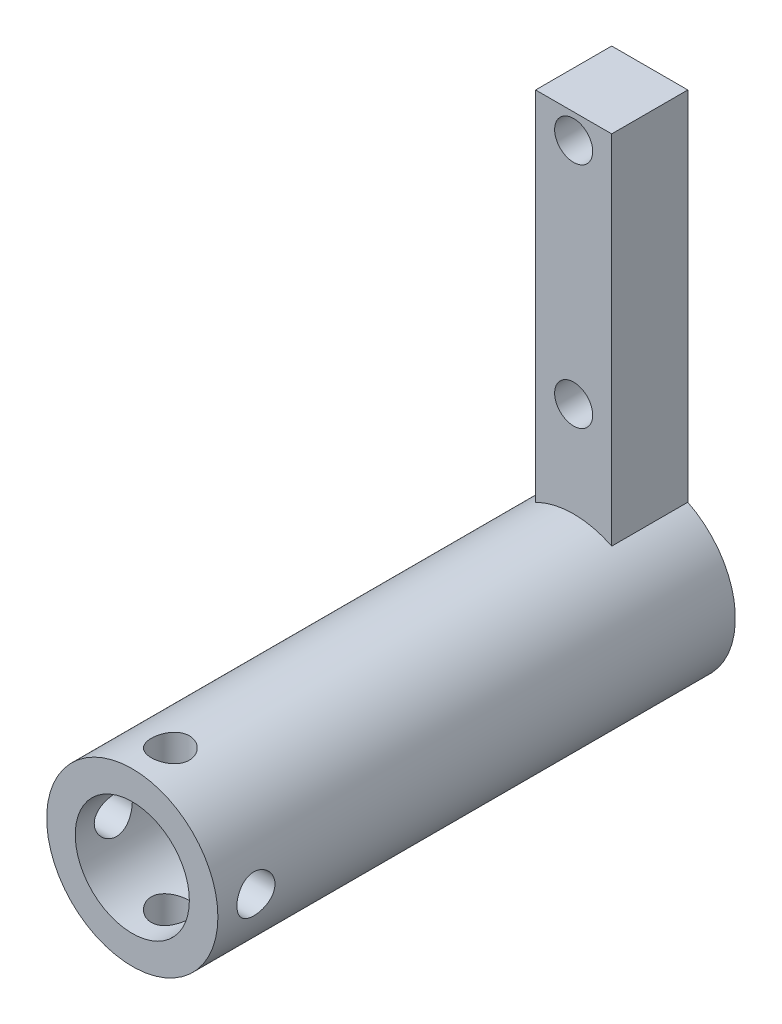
ISO-10303-21;
HEADER;
FILE_DESCRIPTION(('STEP AP214'),'2;1');
FILE_NAME('part.step','',(''),(''),'','','');
FILE_SCHEMA(('AUTOMOTIVE_DESIGN { 1 0 10303 214 1 1 1 1 }'));
ENDSEC;
DATA;
#1=APPLICATION_CONTEXT('core data for automotive mechanical design processes');
#2=APPLICATION_PROTOCOL_DEFINITION('international standard','automotive_design',2000,#1);
#3=PRODUCT_CONTEXT('',#1,'mechanical');
#4=PRODUCT('Part','Part','',(#3));
#5=PRODUCT_RELATED_PRODUCT_CATEGORY('part','',(#4));
#6=PRODUCT_DEFINITION_FORMATION('','',#4);
#7=PRODUCT_DEFINITION_CONTEXT('part definition',#1,'design');
#8=PRODUCT_DEFINITION('design','',#6,#7);
#9=PRODUCT_DEFINITION_SHAPE('','',#8);
#10=(LENGTH_UNIT() NAMED_UNIT(*) SI_UNIT(.MILLI.,.METRE.));
#11=(NAMED_UNIT(*) PLANE_ANGLE_UNIT() SI_UNIT($,.RADIAN.));
#12=(NAMED_UNIT(*) SI_UNIT($,.STERADIAN.) SOLID_ANGLE_UNIT());
#13=UNCERTAINTY_MEASURE_WITH_UNIT(LENGTH_MEASURE(1.E-05),#10,'distance_accuracy_value','');
#14=(GEOMETRIC_REPRESENTATION_CONTEXT(3) GLOBAL_UNCERTAINTY_ASSIGNED_CONTEXT((#13)) GLOBAL_UNIT_ASSIGNED_CONTEXT((#10,
#11,#12)) REPRESENTATION_CONTEXT('',''));
#15=CARTESIAN_POINT('',(0.,0.,0.));
#16=DIRECTION('',(0.,0.,1.));
#17=DIRECTION('',(1.,0.,0.));
#18=AXIS2_PLACEMENT_3D('',#15,#16,#17);
#19=CARTESIAN_POINT('',(0.,0.,10.));
#20=DIRECTION('',(0.,0.,1.));
#21=DIRECTION('',(1.,0.,0.));
#22=AXIS2_PLACEMENT_3D('',#19,#20,#21);
#23=PLANE('',#22);
#24=CARTESIAN_POINT('',(0.,0.,10.));
#25=DIRECTION('',(0.,0.,1.));
#26=DIRECTION('',(1.,0.,0.));
#27=AXIS2_PLACEMENT_3D('',#24,#25,#26);
#28=CIRCLE('',#27,22.5);
#29=CARTESIAN_POINT('',(22.5,0.,10.));
#30=VERTEX_POINT('',#29);
#31=EDGE_CURVE('E43',#30,#30,#28,.T.);
#32=ORIENTED_EDGE('',*,*,#31,.T.);
#33=EDGE_LOOP('',(#32));
#34=FACE_BOUND('',#33,.T.);
#35=CARTESIAN_POINT('',(0.,0.,10.));
#36=DIRECTION('',(0.,0.,1.));
#37=DIRECTION('',(1.,0.,0.));
#38=AXIS2_PLACEMENT_3D('',#35,#36,#37);
#39=CIRCLE('',#38,15.);
#40=CARTESIAN_POINT('',(15.,0.,10.));
#41=VERTEX_POINT('',#40);
#42=EDGE_CURVE('E187',#41,#41,#39,.T.);
#43=ORIENTED_EDGE('',*,*,#42,.F.);
#44=EDGE_LOOP('',(#43));
#45=FACE_BOUND('',#44,.T.);
#46=ADVANCED_FACE('F33',(#34,#45),#23,.T.);
#47=CARTESIAN_POINT('',(0.,0.,10.));
#48=DIRECTION('',(0.,0.,-1.));
#49=DIRECTION('',(-1.,0.,0.));
#50=AXIS2_PLACEMENT_3D('',#47,#48,#49);
#51=CYLINDRICAL_SURFACE('',#50,22.5);
#52=CARTESIAN_POINT('',(0.,0.,-126.));
#53=DIRECTION('',(0.,0.,1.));
#54=DIRECTION('',(1.,0.,0.));
#55=AXIS2_PLACEMENT_3D('',#52,#53,#54);
#56=CIRCLE('',#55,22.5);
#57=CARTESIAN_POINT('',(-10.,20.1556443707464,-126.));
#58=VERTEX_POINT('',#57);
#59=CARTESIAN_POINT('',(10.,20.1556443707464,-126.));
#60=VERTEX_POINT('',#59);
#61=EDGE_CURVE('E81',#58,#60,#56,.T.);
#62=ORIENTED_EDGE('',*,*,#61,.T.);
#63=DIRECTION('',(0.,0.,-1.));
#64=VECTOR('',#63,1.);
#65=CARTESIAN_POINT('',(10.,20.1556443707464,10.));
#66=LINE('',#65,#64);
#67=CARTESIAN_POINT('',(10.,20.1556443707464,-106.));
#68=VERTEX_POINT('',#67);
#69=EDGE_CURVE('E51',#60,#68,#66,.F.);
#70=ORIENTED_EDGE('',*,*,#69,.T.);
#71=CARTESIAN_POINT('',(0.,0.,-106.));
#72=DIRECTION('',(0.,0.,-1.));
#73=DIRECTION('',(-1.,0.,0.));
#74=AXIS2_PLACEMENT_3D('',#71,#72,#73);
#75=CIRCLE('',#74,22.5);
#76=CARTESIAN_POINT('',(-10.,20.1556443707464,-106.));
#77=VERTEX_POINT('',#76);
#78=EDGE_CURVE('E11',#77,#68,#75,.T.);
#79=ORIENTED_EDGE('',*,*,#78,.F.);
#80=DIRECTION('',(0.,0.,-1.));
#81=VECTOR('',#80,1.);
#82=CARTESIAN_POINT('',(-10.,20.1556443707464,10.));
#83=LINE('',#82,#81);
#84=EDGE_CURVE('E106',#77,#58,#83,.T.);
#85=ORIENTED_EDGE('',*,*,#84,.T.);
#86=EDGE_LOOP('',(#62,#70,#79,#85));
#87=FACE_BOUND('',#86,.T.);
#88=CARTESIAN_POINT('',(0.,-22.5,5.));
#89=CARTESIAN_POINT('',(0.27720119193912,-22.4999949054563,4.99999069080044));
#90=CARTESIAN_POINT('',(0.55451391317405,-22.4948253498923,4.97687004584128));
#91=CARTESIAN_POINT('',(1.10125486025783,-22.4747024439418,4.88509881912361));
#92=CARTESIAN_POINT('',(1.37067743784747,-22.4597422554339,4.81641641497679));
#93=CARTESIAN_POINT('',(1.89365819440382,-22.421702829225,4.63578507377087));
#94=CARTESIAN_POINT('',(2.14723288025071,-22.3986322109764,4.52388205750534));
#95=CARTESIAN_POINT('',(2.6320004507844,-22.3468583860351,4.26013346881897));
#96=CARTESIAN_POINT('',(2.86319376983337,-22.3181552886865,4.1082886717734));
#97=CARTESIAN_POINT('',(3.30046578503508,-22.2577273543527,3.76631083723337));
#98=CARTESIAN_POINT('',(3.50612153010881,-22.2259640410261,3.57564374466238));
#99=CARTESIAN_POINT('',(3.88281227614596,-22.1632650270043,3.16257984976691));
#100=CARTESIAN_POINT('',(4.05384411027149,-22.132329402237,2.94018014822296));
#101=CARTESIAN_POINT('',(4.35831108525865,-22.0744082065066,2.46682038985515));
#102=CARTESIAN_POINT('',(4.49129355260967,-22.0474718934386,2.21556260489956));
#103=CARTESIAN_POINT('',(4.71298247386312,-22.0011524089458,1.69356809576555));
#104=CARTESIAN_POINT('',(4.80169440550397,-21.9817683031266,1.42283378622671));
#105=CARTESIAN_POINT('',(4.93092145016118,-21.9531402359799,0.874166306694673));
#106=CARTESIAN_POINT('',(4.97218667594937,-21.9437386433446,0.596418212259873));
#107=CARTESIAN_POINT('',(5.00768177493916,-21.9356668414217,0.0377944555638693));
#108=CARTESIAN_POINT('',(5.00191762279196,-21.9369952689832,-0.243080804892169));
#109=CARTESIAN_POINT('',(4.94412068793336,-21.9500908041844,-0.794391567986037));
#110=CARTESIAN_POINT('',(4.89296161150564,-21.9616607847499,-1.06492406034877));
#111=CARTESIAN_POINT('',(4.74721226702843,-21.993623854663,-1.5934678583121));
#112=CARTESIAN_POINT('',(4.65261949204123,-22.0140174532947,-1.85147844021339));
#113=CARTESIAN_POINT('',(4.42189182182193,-22.0615227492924,-2.35009859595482));
#114=CARTESIAN_POINT('',(4.28542298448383,-22.0886881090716,-2.59054831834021));
#115=CARTESIAN_POINT('',(3.97505170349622,-22.1466434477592,-3.0454571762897));
#116=CARTESIAN_POINT('',(3.80114400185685,-22.1774339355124,-3.25991265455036));
#117=CARTESIAN_POINT('',(3.41621709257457,-22.2400143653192,-3.66177327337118));
#118=CARTESIAN_POINT('',(3.20445551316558,-22.2718112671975,-3.84846696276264));
#119=CARTESIAN_POINT('',(2.75226654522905,-22.3321959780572,-4.18380932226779));
#120=CARTESIAN_POINT('',(2.51183860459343,-22.3607837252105,-4.33245725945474));
#121=CARTESIAN_POINT('',(2.00825797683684,-22.4116266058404,-4.58767318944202));
#122=CARTESIAN_POINT('',(1.74505530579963,-22.4338673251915,-4.69414561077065));
#123=CARTESIAN_POINT('',(1.20388982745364,-22.4694034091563,-4.86115253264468));
#124=CARTESIAN_POINT('',(0.925929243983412,-22.4827001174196,-4.92169393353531));
#125=CARTESIAN_POINT('',(0.369238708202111,-22.4986579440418,-4.99408003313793));
#126=CARTESIAN_POINT('',(0.090640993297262,-22.5015312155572,-5.00689625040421));
#127=CARTESIAN_POINT('',(-0.464714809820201,-22.496913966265,-4.98610473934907));
#128=CARTESIAN_POINT('',(-0.741473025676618,-22.4894241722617,-4.95250026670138));
#129=CARTESIAN_POINT('',(-1.28205814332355,-22.4650564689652,-4.84062646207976));
#130=CARTESIAN_POINT('',(-1.5459962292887,-22.4482861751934,-4.76286885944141));
#131=CARTESIAN_POINT('',(-2.05708201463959,-22.4072355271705,-4.56546578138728));
#132=CARTESIAN_POINT('',(-2.30422825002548,-22.3829545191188,-4.44581665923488));
#133=CARTESIAN_POINT('',(-2.77871609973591,-22.3290538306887,-4.16601780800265));
#134=CARTESIAN_POINT('',(-3.00571432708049,-22.2993611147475,-4.005300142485));
#135=CARTESIAN_POINT('',(-3.42986741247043,-22.2380758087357,-3.64867187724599));
#136=CARTESIAN_POINT('',(-3.6270182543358,-22.2064829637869,-3.45275654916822));
#137=CARTESIAN_POINT('',(-3.98973870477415,-22.1442219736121,-3.02682991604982));
#138=CARTESIAN_POINT('',(-4.15463454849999,-22.1135829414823,-2.7962397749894));
#139=CARTESIAN_POINT('',(-4.44336529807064,-22.0573848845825,-2.31006991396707));
#140=CARTESIAN_POINT('',(-4.5672019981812,-22.0318256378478,-2.05449128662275));
#141=CARTESIAN_POINT('',(-4.76945004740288,-21.9889300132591,-1.52697927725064));
#142=CARTESIAN_POINT('',(-4.84811965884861,-21.9715469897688,-1.255148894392));
#143=CARTESIAN_POINT('',(-4.95855069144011,-21.9468912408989,-0.701689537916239));
#144=CARTESIAN_POINT('',(-4.99031989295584,-21.9396168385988,-0.420062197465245));
#145=CARTESIAN_POINT('',(-5.00570891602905,-21.936110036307,0.138197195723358));
#146=CARTESIAN_POINT('',(-4.99039782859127,-21.9396324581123,0.414798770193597));
#147=CARTESIAN_POINT('',(-4.91445692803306,-21.956766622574,0.961374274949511));
#148=CARTESIAN_POINT('',(-4.85382768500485,-21.9703782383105,1.23134828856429));
#149=CARTESIAN_POINT('',(-4.68949549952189,-22.0060357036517,1.75612280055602));
#150=CARTESIAN_POINT('',(-4.58595291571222,-22.0280501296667,2.01097579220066));
#151=CARTESIAN_POINT('',(-4.33886925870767,-22.078044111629,2.49984998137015));
#152=CARTESIAN_POINT('',(-4.1953238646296,-22.1060243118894,2.73386892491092));
#153=CARTESIAN_POINT('',(-3.86878397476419,-22.1655260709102,3.179691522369));
#154=CARTESIAN_POINT('',(-3.68502963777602,-22.1971092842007,3.39093051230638));
#155=CARTESIAN_POINT('',(-3.28482176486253,-22.2598493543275,3.77992518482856));
#156=CARTESIAN_POINT('',(-3.06836066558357,-22.2910061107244,3.9576731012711));
#157=CARTESIAN_POINT('',(-2.60536492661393,-22.3498814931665,4.27693995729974));
#158=CARTESIAN_POINT('',(-2.35846409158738,-22.3775480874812,4.41793799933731));
#159=CARTESIAN_POINT('',(-1.84390069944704,-22.4258014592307,4.65620826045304));
#160=CARTESIAN_POINT('',(-1.57625550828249,-22.4463940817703,4.75351660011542));
#161=CARTESIAN_POINT('',(-1.09034561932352,-22.474570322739,4.88460337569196));
#162=CARTESIAN_POINT('',(-0.874679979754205,-22.4840467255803,4.92779343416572));
#163=CARTESIAN_POINT('',(-0.43936612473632,-22.4967634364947,4.98549476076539));
#164=CARTESIAN_POINT('',(-0.219718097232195,-22.5000040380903,5.00000737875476));
#165=CARTESIAN_POINT('',(0.,-22.5,5.));
#166=B_SPLINE_CURVE_WITH_KNOTS('',3,(#88,#89,#90,#91,#92,#93,#94,#95,#96,#97,#98,#99,#100,#101,
#102,#103,#104,#105,#106,#107,#108,#109,#110,#111,#112,#113,#114,#115,#116,#117,#118,#119,#120,
#121,#122,#123,#124,#125,#126,#127,#128,#129,#130,#131,#132,#133,#134,#135,#136,#137,#138,#139,
#140,#141,#142,#143,#144,#145,#146,#147,#148,#149,#150,#151,#152,#153,#154,#155,#156,#157,#158,
#159,#160,#161,#162,#163,#164,#165),.UNSPECIFIED.,.T.,.F.,(4,2,2,2,2,2,2,2,2,2,2,2,2,2,2,2,2,2,
2,2,2,2,2,2,2,2,2,2,2,2,2,2,2,2,2,2,2,2,4),(0.,0.830799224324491,1.66217932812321,
2.49267853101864,3.32316161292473,4.16595180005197,5.00881903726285,5.8613324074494,
6.7137402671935,7.55247814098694,8.39110946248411,9.21394170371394,10.0368214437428,
10.8664417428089,11.6961786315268,12.5444544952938,13.392746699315,14.2429503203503,
15.093026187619,15.9256998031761,16.758315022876,17.5814717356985,18.4047001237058,
19.2399950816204,20.0754023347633,20.9267368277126,21.7780341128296,22.6244139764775,
23.4706534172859,24.2978196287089,25.1249754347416,25.9490678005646,26.7732492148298,
27.6146081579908,28.4561619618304,29.3090646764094,30.1612609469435,30.8198086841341,
31.4783254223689),.UNSPECIFIED.);
#167=CARTESIAN_POINT('',(0.,-22.5,5.));
#168=VERTEX_POINT('',#167);
#169=EDGE_CURVE('E117',#168,#168,#166,.T.);
#170=ORIENTED_EDGE('',*,*,#169,.T.);
#171=EDGE_LOOP('',(#170));
#172=FACE_BOUND('',#171,.T.);
#173=CARTESIAN_POINT('',(0.,22.5,5.));
#174=CARTESIAN_POINT('',(-0.277201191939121,22.4999949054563,4.99999069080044));
#175=CARTESIAN_POINT('',(-0.554513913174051,22.4948253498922,4.97687004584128));
#176=CARTESIAN_POINT('',(-1.10125486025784,22.4747024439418,4.88509881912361));
#177=CARTESIAN_POINT('',(-1.37067743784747,22.4597422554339,4.81641641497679));
#178=CARTESIAN_POINT('',(-1.89365819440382,22.421702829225,4.63578507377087));
#179=CARTESIAN_POINT('',(-2.14723288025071,22.3986322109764,4.52388205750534));
#180=CARTESIAN_POINT('',(-2.63200045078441,22.3468583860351,4.26013346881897));
#181=CARTESIAN_POINT('',(-2.86319376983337,22.3181552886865,4.1082886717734));
#182=CARTESIAN_POINT('',(-3.30046578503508,22.2577273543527,3.76631083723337));
#183=CARTESIAN_POINT('',(-3.50612153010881,22.2259640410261,3.57564374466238));
#184=CARTESIAN_POINT('',(-3.88281227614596,22.1632650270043,3.16257984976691));
#185=CARTESIAN_POINT('',(-4.05384411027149,22.132329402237,2.94018014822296));
#186=CARTESIAN_POINT('',(-4.35831108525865,22.0744082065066,2.46682038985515));
#187=CARTESIAN_POINT('',(-4.49129355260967,22.0474718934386,2.21556260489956));
#188=CARTESIAN_POINT('',(-4.71298247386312,22.0011524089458,1.69356809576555));
#189=CARTESIAN_POINT('',(-4.80169440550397,21.9817683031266,1.4228337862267));
#190=CARTESIAN_POINT('',(-4.93092145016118,21.9531402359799,0.874166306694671));
#191=CARTESIAN_POINT('',(-4.97218667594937,21.9437386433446,0.596418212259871));
#192=CARTESIAN_POINT('',(-5.00768177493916,21.9356668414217,0.0377944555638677));
#193=CARTESIAN_POINT('',(-5.00191762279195,21.9369952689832,-0.24308080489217));
#194=CARTESIAN_POINT('',(-4.94412068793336,21.9500908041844,-0.794391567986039));
#195=CARTESIAN_POINT('',(-4.89296161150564,21.9616607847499,-1.06492406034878));
#196=CARTESIAN_POINT('',(-4.74721226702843,21.993623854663,-1.5934678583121));
#197=CARTESIAN_POINT('',(-4.65261949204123,22.0140174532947,-1.85147844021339));
#198=CARTESIAN_POINT('',(-4.42189182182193,22.0615227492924,-2.35009859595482));
#199=CARTESIAN_POINT('',(-4.28542298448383,22.0886881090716,-2.59054831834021));
#200=CARTESIAN_POINT('',(-3.97505170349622,22.1466434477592,-3.0454571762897));
#201=CARTESIAN_POINT('',(-3.80114400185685,22.1774339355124,-3.25991265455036));
#202=CARTESIAN_POINT('',(-3.41621709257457,22.2400143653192,-3.66177327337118));
#203=CARTESIAN_POINT('',(-3.20445551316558,22.2718112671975,-3.84846696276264));
#204=CARTESIAN_POINT('',(-2.75226654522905,22.3321959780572,-4.18380932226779));
#205=CARTESIAN_POINT('',(-2.51183860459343,22.3607837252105,-4.33245725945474));
#206=CARTESIAN_POINT('',(-2.00825797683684,22.4116266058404,-4.58767318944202));
#207=CARTESIAN_POINT('',(-1.74505530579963,22.4338673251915,-4.69414561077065));
#208=CARTESIAN_POINT('',(-1.20388982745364,22.4694034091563,-4.86115253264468));
#209=CARTESIAN_POINT('',(-0.925929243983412,22.4827001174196,-4.92169393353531));
#210=CARTESIAN_POINT('',(-0.369238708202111,22.4986579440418,-4.99408003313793));
#211=CARTESIAN_POINT('',(-0.090640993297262,22.5015312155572,-5.00689625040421));
#212=CARTESIAN_POINT('',(0.464714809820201,22.496913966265,-4.98610473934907));
#213=CARTESIAN_POINT('',(0.741473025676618,22.4894241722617,-4.95250026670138));
#214=CARTESIAN_POINT('',(1.28205814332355,22.4650564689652,-4.84062646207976));
#215=CARTESIAN_POINT('',(1.5459962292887,22.4482861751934,-4.76286885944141));
#216=CARTESIAN_POINT('',(2.05708201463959,22.4072355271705,-4.56546578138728));
#217=CARTESIAN_POINT('',(2.30422825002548,22.3829545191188,-4.44581665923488));
#218=CARTESIAN_POINT('',(2.77871609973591,22.3290538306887,-4.16601780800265));
#219=CARTESIAN_POINT('',(3.00571432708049,22.2993611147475,-4.005300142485));
#220=CARTESIAN_POINT('',(3.42986741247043,22.2380758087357,-3.64867187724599));
#221=CARTESIAN_POINT('',(3.6270182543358,22.2064829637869,-3.45275654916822));
#222=CARTESIAN_POINT('',(3.98973870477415,22.1442219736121,-3.02682991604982));
#223=CARTESIAN_POINT('',(4.1546345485,22.1135829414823,-2.7962397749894));
#224=CARTESIAN_POINT('',(4.44336529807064,22.0573848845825,-2.31006991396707));
#225=CARTESIAN_POINT('',(4.5672019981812,22.0318256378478,-2.05449128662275));
#226=CARTESIAN_POINT('',(4.76945004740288,21.9889300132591,-1.52697927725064));
#227=CARTESIAN_POINT('',(4.84811965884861,21.9715469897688,-1.25514889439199));
#228=CARTESIAN_POINT('',(4.95855069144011,21.9468912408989,-0.701689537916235));
#229=CARTESIAN_POINT('',(4.99031989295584,21.9396168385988,-0.420062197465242));
#230=CARTESIAN_POINT('',(5.00570891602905,21.936110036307,0.138197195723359));
#231=CARTESIAN_POINT('',(4.99039782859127,21.9396324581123,0.414798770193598));
#232=CARTESIAN_POINT('',(4.91445692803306,21.956766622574,0.961374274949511));
#233=CARTESIAN_POINT('',(4.85382768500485,21.9703782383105,1.23134828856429));
#234=CARTESIAN_POINT('',(4.68949549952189,22.0060357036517,1.75612280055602));
#235=CARTESIAN_POINT('',(4.58595291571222,22.0280501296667,2.01097579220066));
#236=CARTESIAN_POINT('',(4.33886925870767,22.078044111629,2.49984998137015));
#237=CARTESIAN_POINT('',(4.1953238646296,22.1060243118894,2.73386892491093));
#238=CARTESIAN_POINT('',(3.86878397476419,22.1655260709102,3.179691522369));
#239=CARTESIAN_POINT('',(3.68502963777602,22.1971092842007,3.39093051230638));
#240=CARTESIAN_POINT('',(3.28482176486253,22.2598493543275,3.77992518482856));
#241=CARTESIAN_POINT('',(3.06836066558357,22.2910061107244,3.9576731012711));
#242=CARTESIAN_POINT('',(2.60536492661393,22.3498814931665,4.27693995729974));
#243=CARTESIAN_POINT('',(2.35846409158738,22.3775480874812,4.41793799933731));
#244=CARTESIAN_POINT('',(1.84390069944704,22.4258014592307,4.65620826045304));
#245=CARTESIAN_POINT('',(1.57625550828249,22.4463940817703,4.75351660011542));
#246=CARTESIAN_POINT('',(1.09034561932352,22.474570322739,4.88460337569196));
#247=CARTESIAN_POINT('',(0.874679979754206,22.4840467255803,4.92779343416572));
#248=CARTESIAN_POINT('',(0.439366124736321,22.4967634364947,4.98549476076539));
#249=CARTESIAN_POINT('',(0.219718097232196,22.5000040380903,5.00000737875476));
#250=CARTESIAN_POINT('',(0.,22.5,5.));
#251=B_SPLINE_CURVE_WITH_KNOTS('',3,(#173,#174,#175,#176,#177,#178,#179,#180,#181,#182,#183,
#184,#185,#186,#187,#188,#189,#190,#191,#192,#193,#194,#195,#196,#197,#198,#199,#200,#201,#202,
#203,#204,#205,#206,#207,#208,#209,#210,#211,#212,#213,#214,#215,#216,#217,#218,#219,#220,#221,
#222,#223,#224,#225,#226,#227,#228,#229,#230,#231,#232,#233,#234,#235,#236,#237,#238,#239,#240,
#241,#242,#243,#244,#245,#246,#247,#248,#249,#250),.UNSPECIFIED.,.T.,.F.,(4,2,2,2,2,2,2,2,2,2,2,
2,2,2,2,2,2,2,2,2,2,2,2,2,2,2,2,2,2,2,2,2,2,2,2,2,2,2,4),(0.,0.830799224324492,1.66217932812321,
2.49267853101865,3.32316161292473,4.16595180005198,5.00881903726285,5.8613324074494,
6.7137402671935,7.55247814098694,8.39110946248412,9.21394170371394,10.0368214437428,
10.8664417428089,11.6961786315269,12.5444544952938,13.392746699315,14.2429503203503,
15.093026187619,15.9256998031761,16.758315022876,17.5814717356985,18.4047001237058,
19.2399950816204,20.0754023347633,20.9267368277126,21.7780341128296,22.6244139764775,
23.4706534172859,24.2978196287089,25.1249754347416,25.9490678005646,26.7732492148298,
27.6146081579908,28.4561619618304,29.3090646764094,30.1612609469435,30.8198086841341,
31.4783254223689),.UNSPECIFIED.);
#252=CARTESIAN_POINT('',(0.,22.5,5.));
#253=VERTEX_POINT('',#252);
#254=EDGE_CURVE('E111',#253,#253,#251,.T.);
#255=ORIENTED_EDGE('',*,*,#254,.T.);
#256=EDGE_LOOP('',(#255));
#257=FACE_BOUND('',#256,.T.);
#258=CARTESIAN_POINT('',(-22.5,0.,5.));
#259=CARTESIAN_POINT('',(-22.4999949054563,-0.277201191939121,4.99999069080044));
#260=CARTESIAN_POINT('',(-22.4948253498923,-0.55451391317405,4.97687004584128));
#261=CARTESIAN_POINT('',(-22.4747024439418,-1.10125486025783,4.88509881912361));
#262=CARTESIAN_POINT('',(-22.4597422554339,-1.37067743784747,4.81641641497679));
#263=CARTESIAN_POINT('',(-22.421702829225,-1.89365819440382,4.63578507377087));
#264=CARTESIAN_POINT('',(-22.3986322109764,-2.14723288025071,4.52388205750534));
#265=CARTESIAN_POINT('',(-22.3468583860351,-2.6320004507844,4.26013346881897));
#266=CARTESIAN_POINT('',(-22.3181552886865,-2.86319376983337,4.1082886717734));
#267=CARTESIAN_POINT('',(-22.2577273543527,-3.30046578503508,3.76631083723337));
#268=CARTESIAN_POINT('',(-22.2259640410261,-3.50612153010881,3.57564374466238));
#269=CARTESIAN_POINT('',(-22.1632650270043,-3.88281227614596,3.16257984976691));
#270=CARTESIAN_POINT('',(-22.132329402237,-4.05384411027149,2.94018014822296));
#271=CARTESIAN_POINT('',(-22.0744082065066,-4.35831108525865,2.46682038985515));
#272=CARTESIAN_POINT('',(-22.0474718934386,-4.49129355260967,2.21556260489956));
#273=CARTESIAN_POINT('',(-22.0011524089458,-4.71298247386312,1.69356809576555));
#274=CARTESIAN_POINT('',(-21.9817683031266,-4.80169440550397,1.42283378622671));
#275=CARTESIAN_POINT('',(-21.9531402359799,-4.93092145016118,0.874166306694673));
#276=CARTESIAN_POINT('',(-21.9437386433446,-4.97218667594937,0.596418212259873));
#277=CARTESIAN_POINT('',(-21.9356668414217,-5.00768177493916,0.037794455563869));
#278=CARTESIAN_POINT('',(-21.9369952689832,-5.00191762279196,-0.243080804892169));
#279=CARTESIAN_POINT('',(-21.9500908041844,-4.94412068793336,-0.794391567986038));
#280=CARTESIAN_POINT('',(-21.9616607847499,-4.89296161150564,-1.06492406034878));
#281=CARTESIAN_POINT('',(-21.993623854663,-4.74721226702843,-1.5934678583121));
#282=CARTESIAN_POINT('',(-22.0140174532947,-4.65261949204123,-1.85147844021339));
#283=CARTESIAN_POINT('',(-22.0615227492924,-4.42189182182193,-2.35009859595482));
#284=CARTESIAN_POINT('',(-22.0886881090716,-4.28542298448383,-2.59054831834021));
#285=CARTESIAN_POINT('',(-22.1466434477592,-3.97505170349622,-3.0454571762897));
#286=CARTESIAN_POINT('',(-22.1774339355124,-3.80114400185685,-3.25991265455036));
#287=CARTESIAN_POINT('',(-22.2400143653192,-3.41621709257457,-3.66177327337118));
#288=CARTESIAN_POINT('',(-22.2718112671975,-3.20445551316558,-3.84846696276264));
#289=CARTESIAN_POINT('',(-22.3321959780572,-2.75226654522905,-4.18380932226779));
#290=CARTESIAN_POINT('',(-22.3607837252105,-2.51183860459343,-4.33245725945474));
#291=CARTESIAN_POINT('',(-22.4116266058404,-2.00825797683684,-4.58767318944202));
#292=CARTESIAN_POINT('',(-22.4338673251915,-1.74505530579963,-4.69414561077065));
#293=CARTESIAN_POINT('',(-22.4694034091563,-1.20388982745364,-4.86115253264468));
#294=CARTESIAN_POINT('',(-22.4827001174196,-0.925929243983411,-4.92169393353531));
#295=CARTESIAN_POINT('',(-22.4986579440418,-0.369238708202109,-4.99408003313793));
#296=CARTESIAN_POINT('',(-22.5015312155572,-0.0906409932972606,-5.00689625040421));
#297=CARTESIAN_POINT('',(-22.496913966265,0.464714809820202,-4.98610473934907));
#298=CARTESIAN_POINT('',(-22.4894241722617,0.741473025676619,-4.95250026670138));
#299=CARTESIAN_POINT('',(-22.4650564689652,1.28205814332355,-4.84062646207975));
#300=CARTESIAN_POINT('',(-22.4482861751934,1.5459962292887,-4.76286885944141));
#301=CARTESIAN_POINT('',(-22.4072355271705,2.05708201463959,-4.56546578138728));
#302=CARTESIAN_POINT('',(-22.3829545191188,2.30422825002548,-4.44581665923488));
#303=CARTESIAN_POINT('',(-22.3290538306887,2.77871609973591,-4.16601780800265));
#304=CARTESIAN_POINT('',(-22.2993611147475,3.00571432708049,-4.005300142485));
#305=CARTESIAN_POINT('',(-22.2380758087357,3.42986741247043,-3.64867187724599));
#306=CARTESIAN_POINT('',(-22.2064829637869,3.6270182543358,-3.45275654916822));
#307=CARTESIAN_POINT('',(-22.1442219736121,3.98973870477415,-3.02682991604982));
#308=CARTESIAN_POINT('',(-22.1135829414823,4.15463454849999,-2.7962397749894));
#309=CARTESIAN_POINT('',(-22.0573848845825,4.44336529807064,-2.31006991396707));
#310=CARTESIAN_POINT('',(-22.0318256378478,4.5672019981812,-2.05449128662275));
#311=CARTESIAN_POINT('',(-21.9889300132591,4.76945004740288,-1.52697927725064));
#312=CARTESIAN_POINT('',(-21.9715469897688,4.84811965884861,-1.255148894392));
#313=CARTESIAN_POINT('',(-21.9468912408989,4.95855069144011,-0.701689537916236));
#314=CARTESIAN_POINT('',(-21.9396168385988,4.99031989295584,-0.420062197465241));
#315=CARTESIAN_POINT('',(-21.936110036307,5.00570891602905,0.138197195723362));
#316=CARTESIAN_POINT('',(-21.9396324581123,4.99039782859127,0.414798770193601));
#317=CARTESIAN_POINT('',(-21.956766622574,4.91445692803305,0.961374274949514));
#318=CARTESIAN_POINT('',(-21.9703782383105,4.85382768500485,1.23134828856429));
#319=CARTESIAN_POINT('',(-22.0060357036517,4.68949549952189,1.75612280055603));
#320=CARTESIAN_POINT('',(-22.0280501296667,4.58595291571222,2.01097579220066));
#321=CARTESIAN_POINT('',(-22.078044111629,4.33886925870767,2.49984998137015));
#322=CARTESIAN_POINT('',(-22.1060243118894,4.1953238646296,2.73386892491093));
#323=CARTESIAN_POINT('',(-22.1655260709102,3.86878397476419,3.17969152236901));
#324=CARTESIAN_POINT('',(-22.1971092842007,3.68502963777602,3.39093051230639));
#325=CARTESIAN_POINT('',(-22.2598493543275,3.28482176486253,3.77992518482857));
#326=CARTESIAN_POINT('',(-22.2910061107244,3.06836066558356,3.9576731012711));
#327=CARTESIAN_POINT('',(-22.3498814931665,2.60536492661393,4.27693995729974));
#328=CARTESIAN_POINT('',(-22.3775480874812,2.35846409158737,4.41793799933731));
#329=CARTESIAN_POINT('',(-22.4258014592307,1.84390069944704,4.65620826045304));
#330=CARTESIAN_POINT('',(-22.4463940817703,1.57625550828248,4.75351660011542));
#331=CARTESIAN_POINT('',(-22.474570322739,1.09034561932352,4.88460337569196));
#332=CARTESIAN_POINT('',(-22.4840467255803,0.874679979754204,4.92779343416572));
#333=CARTESIAN_POINT('',(-22.4967634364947,0.43936612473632,4.98549476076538));
#334=CARTESIAN_POINT('',(-22.5000040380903,0.219718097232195,5.00000737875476));
#335=CARTESIAN_POINT('',(-22.5,0.,5.));
#336=B_SPLINE_CURVE_WITH_KNOTS('',3,(#258,#259,#260,#261,#262,#263,#264,#265,#266,#267,#268,
#269,#270,#271,#272,#273,#274,#275,#276,#277,#278,#279,#280,#281,#282,#283,#284,#285,#286,#287,
#288,#289,#290,#291,#292,#293,#294,#295,#296,#297,#298,#299,#300,#301,#302,#303,#304,#305,#306,
#307,#308,#309,#310,#311,#312,#313,#314,#315,#316,#317,#318,#319,#320,#321,#322,#323,#324,#325,
#326,#327,#328,#329,#330,#331,#332,#333,#334,#335),.UNSPECIFIED.,.T.,.F.,(4,2,2,2,2,2,2,2,2,2,2,
2,2,2,2,2,2,2,2,2,2,2,2,2,2,2,2,2,2,2,2,2,2,2,2,2,2,2,4),(0.,0.830799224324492,1.66217932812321,
2.49267853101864,3.32316161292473,4.16595180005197,5.00881903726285,5.8613324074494,
6.7137402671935,7.55247814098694,8.39110946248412,9.21394170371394,10.0368214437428,
10.8664417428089,11.6961786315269,12.5444544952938,13.392746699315,14.2429503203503,
15.093026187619,15.9256998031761,16.758315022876,17.5814717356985,18.4047001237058,
19.2399950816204,20.0754023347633,20.9267368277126,21.7780341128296,22.6244139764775,
23.4706534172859,24.2978196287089,25.1249754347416,25.9490678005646,26.7732492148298,
27.6146081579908,28.4561619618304,29.3090646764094,30.1612609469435,30.8198086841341,
31.4783254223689),.UNSPECIFIED.);
#337=CARTESIAN_POINT('',(-22.5,0.,5.));
#338=VERTEX_POINT('',#337);
#339=EDGE_CURVE('E167',#338,#338,#336,.T.);
#340=ORIENTED_EDGE('',*,*,#339,.T.);
#341=EDGE_LOOP('',(#340));
#342=FACE_BOUND('',#341,.T.);
#343=CARTESIAN_POINT('',(22.5,0.,-5.));
#344=CARTESIAN_POINT('',(22.4999949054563,-0.277201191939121,-4.99999069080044));
#345=CARTESIAN_POINT('',(22.4948253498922,-0.554513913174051,-4.97687004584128));
#346=CARTESIAN_POINT('',(22.4747024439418,-1.10125486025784,-4.88509881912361));
#347=CARTESIAN_POINT('',(22.4597422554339,-1.37067743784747,-4.81641641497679));
#348=CARTESIAN_POINT('',(22.421702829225,-1.89365819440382,-4.63578507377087));
#349=CARTESIAN_POINT('',(22.3986322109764,-2.14723288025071,-4.52388205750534));
#350=CARTESIAN_POINT('',(22.3468583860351,-2.63200045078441,-4.26013346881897));
#351=CARTESIAN_POINT('',(22.3181552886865,-2.86319376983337,-4.1082886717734));
#352=CARTESIAN_POINT('',(22.2577273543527,-3.30046578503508,-3.76631083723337));
#353=CARTESIAN_POINT('',(22.2259640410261,-3.50612153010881,-3.57564374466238));
#354=CARTESIAN_POINT('',(22.1632650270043,-3.88281227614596,-3.16257984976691));
#355=CARTESIAN_POINT('',(22.132329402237,-4.05384411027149,-2.94018014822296));
#356=CARTESIAN_POINT('',(22.0744082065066,-4.35831108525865,-2.46682038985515));
#357=CARTESIAN_POINT('',(22.0474718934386,-4.49129355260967,-2.21556260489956));
#358=CARTESIAN_POINT('',(22.0011524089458,-4.71298247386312,-1.69356809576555));
#359=CARTESIAN_POINT('',(21.9817683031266,-4.80169440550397,-1.4228337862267));
#360=CARTESIAN_POINT('',(21.9531402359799,-4.93092145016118,-0.874166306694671));
#361=CARTESIAN_POINT('',(21.9437386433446,-4.97218667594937,-0.596418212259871));
#362=CARTESIAN_POINT('',(21.9356668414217,-5.00768177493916,-0.0377944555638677));
#363=CARTESIAN_POINT('',(21.9369952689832,-5.00191762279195,0.24308080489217));
#364=CARTESIAN_POINT('',(21.9500908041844,-4.94412068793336,0.794391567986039));
#365=CARTESIAN_POINT('',(21.9616607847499,-4.89296161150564,1.06492406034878));
#366=CARTESIAN_POINT('',(21.993623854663,-4.74721226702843,1.5934678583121));
#367=CARTESIAN_POINT('',(22.0140174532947,-4.65261949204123,1.85147844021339));
#368=CARTESIAN_POINT('',(22.0615227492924,-4.42189182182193,2.35009859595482));
#369=CARTESIAN_POINT('',(22.0886881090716,-4.28542298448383,2.59054831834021));
#370=CARTESIAN_POINT('',(22.1466434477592,-3.97505170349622,3.0454571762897));
#371=CARTESIAN_POINT('',(22.1774339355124,-3.80114400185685,3.25991265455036));
#372=CARTESIAN_POINT('',(22.2400143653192,-3.41621709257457,3.66177327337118));
#373=CARTESIAN_POINT('',(22.2718112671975,-3.20445551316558,3.84846696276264));
#374=CARTESIAN_POINT('',(22.3321959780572,-2.75226654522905,4.18380932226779));
#375=CARTESIAN_POINT('',(22.3607837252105,-2.51183860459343,4.33245725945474));
#376=CARTESIAN_POINT('',(22.4116266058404,-2.00825797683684,4.58767318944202));
#377=CARTESIAN_POINT('',(22.4338673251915,-1.74505530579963,4.69414561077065));
#378=CARTESIAN_POINT('',(22.4694034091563,-1.20388982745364,4.86115253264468));
#379=CARTESIAN_POINT('',(22.4827001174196,-0.925929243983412,4.92169393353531));
#380=CARTESIAN_POINT('',(22.4986579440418,-0.369238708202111,4.99408003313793));
#381=CARTESIAN_POINT('',(22.5015312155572,-0.090640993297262,5.00689625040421));
#382=CARTESIAN_POINT('',(22.496913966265,0.464714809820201,4.98610473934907));
#383=CARTESIAN_POINT('',(22.4894241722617,0.741473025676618,4.95250026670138));
#384=CARTESIAN_POINT('',(22.4650564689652,1.28205814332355,4.84062646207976));
#385=CARTESIAN_POINT('',(22.4482861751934,1.5459962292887,4.76286885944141));
#386=CARTESIAN_POINT('',(22.4072355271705,2.05708201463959,4.56546578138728));
#387=CARTESIAN_POINT('',(22.3829545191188,2.30422825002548,4.44581665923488));
#388=CARTESIAN_POINT('',(22.3290538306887,2.77871609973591,4.16601780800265));
#389=CARTESIAN_POINT('',(22.2993611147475,3.00571432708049,4.005300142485));
#390=CARTESIAN_POINT('',(22.2380758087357,3.42986741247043,3.64867187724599));
#391=CARTESIAN_POINT('',(22.2064829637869,3.6270182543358,3.45275654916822));
#392=CARTESIAN_POINT('',(22.1442219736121,3.98973870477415,3.02682991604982));
#393=CARTESIAN_POINT('',(22.1135829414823,4.1546345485,2.7962397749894));
#394=CARTESIAN_POINT('',(22.0573848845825,4.44336529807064,2.31006991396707));
#395=CARTESIAN_POINT('',(22.0318256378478,4.5672019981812,2.05449128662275));
#396=CARTESIAN_POINT('',(21.9889300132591,4.76945004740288,1.52697927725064));
#397=CARTESIAN_POINT('',(21.9715469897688,4.84811965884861,1.25514889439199));
#398=CARTESIAN_POINT('',(21.9468912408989,4.95855069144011,0.701689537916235));
#399=CARTESIAN_POINT('',(21.9396168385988,4.99031989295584,0.420062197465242));
#400=CARTESIAN_POINT('',(21.936110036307,5.00570891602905,-0.138197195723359));
#401=CARTESIAN_POINT('',(21.9396324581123,4.99039782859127,-0.414798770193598));
#402=CARTESIAN_POINT('',(21.956766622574,4.91445692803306,-0.961374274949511));
#403=CARTESIAN_POINT('',(21.9703782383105,4.85382768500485,-1.23134828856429));
#404=CARTESIAN_POINT('',(22.0060357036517,4.68949549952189,-1.75612280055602));
#405=CARTESIAN_POINT('',(22.0280501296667,4.58595291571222,-2.01097579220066));
#406=CARTESIAN_POINT('',(22.078044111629,4.33886925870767,-2.49984998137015));
#407=CARTESIAN_POINT('',(22.1060243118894,4.1953238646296,-2.73386892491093));
#408=CARTESIAN_POINT('',(22.1655260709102,3.86878397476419,-3.179691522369));
#409=CARTESIAN_POINT('',(22.1971092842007,3.68502963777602,-3.39093051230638));
#410=CARTESIAN_POINT('',(22.2598493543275,3.28482176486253,-3.77992518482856));
#411=CARTESIAN_POINT('',(22.2910061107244,3.06836066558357,-3.9576731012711));
#412=CARTESIAN_POINT('',(22.3498814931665,2.60536492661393,-4.27693995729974));
#413=CARTESIAN_POINT('',(22.3775480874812,2.35846409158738,-4.41793799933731));
#414=CARTESIAN_POINT('',(22.4258014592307,1.84390069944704,-4.65620826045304));
#415=CARTESIAN_POINT('',(22.4463940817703,1.57625550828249,-4.75351660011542));
#416=CARTESIAN_POINT('',(22.474570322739,1.09034561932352,-4.88460337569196));
#417=CARTESIAN_POINT('',(22.4840467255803,0.874679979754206,-4.92779343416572));
#418=CARTESIAN_POINT('',(22.4967634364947,0.439366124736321,-4.98549476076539));
#419=CARTESIAN_POINT('',(22.5000040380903,0.219718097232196,-5.00000737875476));
#420=CARTESIAN_POINT('',(22.5,0.,-5.));
#421=B_SPLINE_CURVE_WITH_KNOTS('',3,(#343,#344,#345,#346,#347,#348,#349,#350,#351,#352,#353,
#354,#355,#356,#357,#358,#359,#360,#361,#362,#363,#364,#365,#366,#367,#368,#369,#370,#371,#372,
#373,#374,#375,#376,#377,#378,#379,#380,#381,#382,#383,#384,#385,#386,#387,#388,#389,#390,#391,
#392,#393,#394,#395,#396,#397,#398,#399,#400,#401,#402,#403,#404,#405,#406,#407,#408,#409,#410,
#411,#412,#413,#414,#415,#416,#417,#418,#419,#420),.UNSPECIFIED.,.T.,.F.,(4,2,2,2,2,2,2,2,2,2,2,
2,2,2,2,2,2,2,2,2,2,2,2,2,2,2,2,2,2,2,2,2,2,2,2,2,2,2,4),(0.,0.830799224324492,1.66217932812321,
2.49267853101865,3.32316161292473,4.16595180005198,5.00881903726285,5.8613324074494,
6.7137402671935,7.55247814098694,8.39110946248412,9.21394170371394,10.0368214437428,
10.8664417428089,11.6961786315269,12.5444544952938,13.392746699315,14.2429503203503,
15.093026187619,15.9256998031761,16.758315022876,17.5814717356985,18.4047001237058,
19.2399950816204,20.0754023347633,20.9267368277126,21.7780341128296,22.6244139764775,
23.4706534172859,24.2978196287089,25.1249754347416,25.9490678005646,26.7732492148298,
27.6146081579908,28.4561619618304,29.3090646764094,30.1612609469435,30.8198086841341,
31.4783254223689),.UNSPECIFIED.);
#422=CARTESIAN_POINT('',(22.5,0.,-5.));
#423=VERTEX_POINT('',#422);
#424=EDGE_CURVE('E163',#423,#423,#421,.T.);
#425=ORIENTED_EDGE('',*,*,#424,.T.);
#426=EDGE_LOOP('',(#425));
#427=FACE_BOUND('',#426,.T.);
#428=ORIENTED_EDGE('',*,*,#31,.F.);
#429=EDGE_LOOP('',(#428));
#430=FACE_BOUND('',#429,.T.);
#431=ADVANCED_FACE('F35',(#87,#172,#257,#342,#427,#430),#51,.T.);
#432=CARTESIAN_POINT('',(0.,0.,10.));
#433=DIRECTION('',(0.,0.,-1.));
#434=DIRECTION('',(-1.,0.,0.));
#435=AXIS2_PLACEMENT_3D('',#432,#433,#434);
#436=CYLINDRICAL_SURFACE('',#435,15.);
#437=CARTESIAN_POINT('',(0.,-15.,5.));
#438=CARTESIAN_POINT('',(0.272816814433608,-15.0000007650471,5.00000126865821));
#439=CARTESIAN_POINT('',(0.545625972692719,-14.9924884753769,4.97759866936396));
#440=CARTESIAN_POINT('',(1.08320880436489,-14.9632605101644,4.88885445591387));
#441=CARTESIAN_POINT('',(1.3479816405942,-14.941543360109,4.82250828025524));
#442=CARTESIAN_POINT('',(1.86166394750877,-14.8862653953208,4.64840378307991));
#443=CARTESIAN_POINT('',(2.11059912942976,-14.8527243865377,4.5407146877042));
#444=CARTESIAN_POINT('',(2.58687468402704,-14.7772222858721,4.2872941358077));
#445=CARTESIAN_POINT('',(2.81421078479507,-14.7352595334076,4.1415551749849));
#446=CARTESIAN_POINT('',(3.24870837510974,-14.6457047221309,3.8108709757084));
#447=CARTESIAN_POINT('',(3.45501850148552,-14.5979778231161,3.62484382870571));
#448=CARTESIAN_POINT('',(3.83416346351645,-14.5030157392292,3.22116422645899));
#449=CARTESIAN_POINT('',(4.00699092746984,-14.4557806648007,3.00350482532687));
#450=CARTESIAN_POINT('',(4.31912471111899,-14.3656666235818,2.53507442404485));
#451=CARTESIAN_POINT('',(4.45732429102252,-14.3229519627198,2.28353130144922));
#452=CARTESIAN_POINT('',(4.68909436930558,-14.2487652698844,1.75911952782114));
#453=CARTESIAN_POINT('',(4.78267848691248,-14.2172898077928,1.48625741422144));
#454=CARTESIAN_POINT('',(4.91936730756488,-14.1705651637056,0.936633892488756));
#455=CARTESIAN_POINT('',(4.96406724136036,-14.1548047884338,0.660313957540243));
#456=CARTESIAN_POINT('',(5.00670561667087,-14.1397828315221,0.103681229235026));
#457=CARTESIAN_POINT('',(5.00465850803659,-14.1405161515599,-0.176630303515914));
#458=CARTESIAN_POINT('',(4.95509951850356,-14.1579507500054,-0.719683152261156));
#459=CARTESIAN_POINT('',(4.90966956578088,-14.1739207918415,-0.982642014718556));
#460=CARTESIAN_POINT('',(4.77803081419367,-14.2188328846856,-1.49696709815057));
#461=CARTESIAN_POINT('',(4.69181713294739,-14.2477764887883,-1.74833192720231));
#462=CARTESIAN_POINT('',(4.47969529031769,-14.3158955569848,-2.2370637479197));
#463=CARTESIAN_POINT('',(4.35317024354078,-14.3552282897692,-2.47414012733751));
#464=CARTESIAN_POINT('',(4.06444553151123,-14.4396279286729,-2.92435454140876));
#465=CARTESIAN_POINT('',(3.9022355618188,-14.4846964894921,-3.13748563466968));
#466=CARTESIAN_POINT('',(3.53674666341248,-14.5783664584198,-3.54545799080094));
#467=CARTESIAN_POINT('',(3.3317657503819,-14.6270294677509,-3.73876347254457));
#468=CARTESIAN_POINT('',(2.89169784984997,-14.7203469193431,-4.08865633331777));
#469=CARTESIAN_POINT('',(2.65660797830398,-14.765000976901,-4.24524019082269));
#470=CARTESIAN_POINT('',(2.15973806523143,-14.8458553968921,-4.51848150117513));
#471=CARTESIAN_POINT('',(1.89771638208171,-14.8819675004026,-4.6347274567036));
#472=CARTESIAN_POINT('',(1.35634541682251,-14.9410283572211,-4.82101586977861));
#473=CARTESIAN_POINT('',(1.07700219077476,-14.9639816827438,-4.8910743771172));
#474=CARTESIAN_POINT('',(0.521919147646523,-14.9933813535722,-4.98027833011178));
#475=CARTESIAN_POINT('',(0.246547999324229,-15.0005000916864,-5.00149904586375));
#476=CARTESIAN_POINT('',(-0.303875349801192,-14.9994451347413,-4.99833663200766));
#477=CARTESIAN_POINT('',(-0.578927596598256,-14.9912740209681,-4.97396120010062));
#478=CARTESIAN_POINT('',(-1.11259933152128,-14.9610012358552,-4.8819404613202));
#479=CARTESIAN_POINT('',(-1.37146403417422,-14.9393099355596,-4.81556896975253));
#480=CARTESIAN_POINT('',(-1.87427979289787,-14.8845923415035,-4.64303277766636));
#481=CARTESIAN_POINT('',(-2.11822894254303,-14.8515646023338,-4.53686300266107));
#482=CARTESIAN_POINT('',(-2.59144148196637,-14.7764465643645,-4.28464784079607));
#483=CARTESIAN_POINT('',(-2.82014979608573,-14.7341407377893,-4.13762703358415));
#484=CARTESIAN_POINT('',(-3.25032415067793,-14.6452626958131,-3.80902924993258));
#485=CARTESIAN_POINT('',(-3.45178183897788,-14.5986891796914,-3.62744171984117));
#486=CARTESIAN_POINT('',(-3.8312625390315,-14.5038423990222,-3.22510624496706));
#487=CARTESIAN_POINT('',(-4.00780484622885,-14.4555880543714,-3.00295386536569));
#488=CARTESIAN_POINT('',(-4.32128761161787,-14.3649986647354,-2.53114216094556));
#489=CARTESIAN_POINT('',(-4.45822773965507,-14.3226636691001,-2.28148260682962));
#490=CARTESIAN_POINT('',(-4.68798465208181,-14.2491195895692,-1.76163492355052));
#491=CARTESIAN_POINT('',(-4.7808906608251,-14.2178880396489,-1.49148960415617));
#492=CARTESIAN_POINT('',(-4.91947333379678,-14.1705416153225,-0.938106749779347));
#493=CARTESIAN_POINT('',(-4.9651712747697,-14.154419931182,-0.654875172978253));
#494=CARTESIAN_POINT('',(-5.00638141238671,-14.1398929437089,-0.0990145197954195));
#495=CARTESIAN_POINT('',(-5.004351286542,-14.1406200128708,0.173411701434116));
#496=CARTESIAN_POINT('',(-4.95621146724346,-14.1575634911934,0.713825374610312));
#497=CARTESIAN_POINT('',(-4.91010439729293,-14.1737789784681,0.981813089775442));
#498=CARTESIAN_POINT('',(-4.77685906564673,-14.2192262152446,1.50067831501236));
#499=CARTESIAN_POINT('',(-4.69051673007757,-14.2482049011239,1.75178412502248));
#500=CARTESIAN_POINT('',(-4.47989682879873,-14.3158199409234,2.23613703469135));
#501=CARTESIAN_POINT('',(-4.35561084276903,-14.3544584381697,2.46938015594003));
#502=CARTESIAN_POINT('',(-4.06630346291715,-14.4391414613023,2.92241834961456));
#503=CARTESIAN_POINT('',(-3.8997412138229,-14.4854355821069,3.14118250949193));
#504=CARTESIAN_POINT('',(-3.53321441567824,-14.5791678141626,3.548449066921));
#505=CARTESIAN_POINT('',(-3.33324042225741,-14.6266062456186,3.73694287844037));
#506=CARTESIAN_POINT('',(-2.89620778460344,-14.7195015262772,4.08572206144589));
#507=CARTESIAN_POINT('',(-2.65800756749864,-14.7648090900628,4.244621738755));
#508=CARTESIAN_POINT('',(-2.15678678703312,-14.8462995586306,4.51995214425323));
#509=CARTESIAN_POINT('',(-1.89377259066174,-14.8824847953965,4.63639372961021));
#510=CARTESIAN_POINT('',(-1.36246823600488,-14.9402757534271,4.81860816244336));
#511=CARTESIAN_POINT('',(-1.09493878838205,-14.9624606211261,4.88641233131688));
#512=CARTESIAN_POINT('',(-0.551602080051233,-14.9923203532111,4.97710140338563));
#513=CARTESIAN_POINT('',(-0.275797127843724,-14.9999992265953,4.99999871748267));
#514=CARTESIAN_POINT('',(0.,-15.,5.));
#515=B_SPLINE_CURVE_WITH_KNOTS('',3,(#437,#438,#439,#440,#441,#442,#443,#444,#445,#446,#447,
#448,#449,#450,#451,#452,#453,#454,#455,#456,#457,#458,#459,#460,#461,#462,#463,#464,#465,#466,
#467,#468,#469,#470,#471,#472,#473,#474,#475,#476,#477,#478,#479,#480,#481,#482,#483,#484,#485,
#486,#487,#488,#489,#490,#491,#492,#493,#494,#495,#496,#497,#498,#499,#500,#501,#502,#503,#504,
#505,#506,#507,#508,#509,#510,#511,#512,#513,#514),.UNSPECIFIED.,.T.,.F.,(4,2,2,2,2,2,2,2,2,2,2,
2,2,2,2,2,2,2,2,2,2,2,2,2,2,2,2,2,2,2,2,2,2,2,2,2,2,2,4),(0.,0.817435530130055,1.6349559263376,
2.45111336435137,3.2674318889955,4.1092342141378,4.95122166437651,5.81741924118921,
6.6833522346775,7.52009628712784,8.3565816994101,9.15484132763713,9.9531965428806,
10.764408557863,11.5758551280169,12.4296652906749,13.2835572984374,14.1459202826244,
15.0079834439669,15.832679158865,16.6572356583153,17.4579078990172,18.2586822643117,
19.0805199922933,19.9026090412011,20.7620511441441,21.6215004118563,22.479200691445,
23.3365142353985,24.1497833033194,24.9630039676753,25.7607793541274,26.5587319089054,
27.3915033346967,28.2245105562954,29.0899830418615,29.9552340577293,30.7818279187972,
31.6081933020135),.UNSPECIFIED.);
#516=CARTESIAN_POINT('',(0.,-15.,5.));
#517=VERTEX_POINT('',#516);
#518=EDGE_CURVE('E118',#517,#517,#515,.T.);
#519=ORIENTED_EDGE('',*,*,#518,.F.);
#520=EDGE_LOOP('',(#519));
#521=FACE_BOUND('',#520,.T.);
#522=CARTESIAN_POINT('',(0.,15.,5.));
#523=CARTESIAN_POINT('',(-0.272816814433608,15.0000007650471,5.00000126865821));
#524=CARTESIAN_POINT('',(-0.54562597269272,14.9924884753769,4.97759866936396));
#525=CARTESIAN_POINT('',(-1.08320880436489,14.9632605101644,4.88885445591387));
#526=CARTESIAN_POINT('',(-1.3479816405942,14.941543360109,4.82250828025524));
#527=CARTESIAN_POINT('',(-1.86166394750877,14.8862653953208,4.64840378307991));
#528=CARTESIAN_POINT('',(-2.11059912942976,14.8527243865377,4.5407146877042));
#529=CARTESIAN_POINT('',(-2.58687468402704,14.7772222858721,4.2872941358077));
#530=CARTESIAN_POINT('',(-2.81421078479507,14.7352595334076,4.1415551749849));
#531=CARTESIAN_POINT('',(-3.24870837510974,14.6457047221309,3.8108709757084));
#532=CARTESIAN_POINT('',(-3.45501850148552,14.5979778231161,3.62484382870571));
#533=CARTESIAN_POINT('',(-3.83416346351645,14.5030157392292,3.22116422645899));
#534=CARTESIAN_POINT('',(-4.00699092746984,14.4557806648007,3.00350482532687));
#535=CARTESIAN_POINT('',(-4.31912471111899,14.3656666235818,2.53507442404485));
#536=CARTESIAN_POINT('',(-4.45732429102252,14.3229519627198,2.28353130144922));
#537=CARTESIAN_POINT('',(-4.68909436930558,14.2487652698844,1.75911952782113));
#538=CARTESIAN_POINT('',(-4.78267848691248,14.2172898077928,1.48625741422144));
#539=CARTESIAN_POINT('',(-4.91936730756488,14.1705651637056,0.936633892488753));
#540=CARTESIAN_POINT('',(-4.96406724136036,14.1548047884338,0.660313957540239));
#541=CARTESIAN_POINT('',(-5.00670561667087,14.1397828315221,0.103681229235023));
#542=CARTESIAN_POINT('',(-5.00465850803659,14.1405161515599,-0.176630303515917));
#543=CARTESIAN_POINT('',(-4.95509951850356,14.1579507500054,-0.719683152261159));
#544=CARTESIAN_POINT('',(-4.90966956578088,14.1739207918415,-0.982642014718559));
#545=CARTESIAN_POINT('',(-4.77803081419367,14.2188328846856,-1.49696709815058));
#546=CARTESIAN_POINT('',(-4.69181713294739,14.2477764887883,-1.74833192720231));
#547=CARTESIAN_POINT('',(-4.47969529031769,14.3158955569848,-2.2370637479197));
#548=CARTESIAN_POINT('',(-4.35317024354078,14.3552282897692,-2.47414012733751));
#549=CARTESIAN_POINT('',(-4.06444553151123,14.4396279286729,-2.92435454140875));
#550=CARTESIAN_POINT('',(-3.9022355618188,14.4846964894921,-3.13748563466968));
#551=CARTESIAN_POINT('',(-3.53674666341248,14.5783664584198,-3.54545799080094));
#552=CARTESIAN_POINT('',(-3.3317657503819,14.6270294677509,-3.73876347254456));
#553=CARTESIAN_POINT('',(-2.89169784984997,14.7203469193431,-4.08865633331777));
#554=CARTESIAN_POINT('',(-2.65660797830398,14.765000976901,-4.24524019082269));
#555=CARTESIAN_POINT('',(-2.15973806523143,14.8458553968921,-4.51848150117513));
#556=CARTESIAN_POINT('',(-1.89771638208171,14.8819675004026,-4.6347274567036));
#557=CARTESIAN_POINT('',(-1.35634541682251,14.9410283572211,-4.82101586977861));
#558=CARTESIAN_POINT('',(-1.07700219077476,14.9639816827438,-4.8910743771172));
#559=CARTESIAN_POINT('',(-0.521919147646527,14.9933813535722,-4.98027833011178));
#560=CARTESIAN_POINT('',(-0.246547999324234,15.0005000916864,-5.00149904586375));
#561=CARTESIAN_POINT('',(0.303875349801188,14.9994451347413,-4.99833663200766));
#562=CARTESIAN_POINT('',(0.578927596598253,14.9912740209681,-4.97396120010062));
#563=CARTESIAN_POINT('',(1.11259933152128,14.9610012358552,-4.8819404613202));
#564=CARTESIAN_POINT('',(1.37146403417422,14.9393099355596,-4.81556896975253));
#565=CARTESIAN_POINT('',(1.87427979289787,14.8845923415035,-4.64303277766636));
#566=CARTESIAN_POINT('',(2.11822894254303,14.8515646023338,-4.53686300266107));
#567=CARTESIAN_POINT('',(2.59144148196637,14.7764465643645,-4.28464784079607));
#568=CARTESIAN_POINT('',(2.82014979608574,14.7341407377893,-4.13762703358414));
#569=CARTESIAN_POINT('',(3.25032415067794,14.6452626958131,-3.80902924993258));
#570=CARTESIAN_POINT('',(3.45178183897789,14.5986891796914,-3.62744171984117));
#571=CARTESIAN_POINT('',(3.8312625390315,14.5038423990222,-3.22510624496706));
#572=CARTESIAN_POINT('',(4.00780484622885,14.4555880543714,-3.0029538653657));
#573=CARTESIAN_POINT('',(4.32128761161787,14.3649986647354,-2.53114216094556));
#574=CARTESIAN_POINT('',(4.45822773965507,14.3226636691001,-2.28148260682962));
#575=CARTESIAN_POINT('',(4.68798465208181,14.2491195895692,-1.76163492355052));
#576=CARTESIAN_POINT('',(4.7808906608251,14.2178880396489,-1.49148960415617));
#577=CARTESIAN_POINT('',(4.91947333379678,14.1705416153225,-0.938106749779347));
#578=CARTESIAN_POINT('',(4.9651712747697,14.154419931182,-0.654875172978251));
#579=CARTESIAN_POINT('',(5.00638141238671,14.1398929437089,-0.0990145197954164));
#580=CARTESIAN_POINT('',(5.004351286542,14.1406200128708,0.173411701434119));
#581=CARTESIAN_POINT('',(4.95621146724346,14.1575634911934,0.713825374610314));
#582=CARTESIAN_POINT('',(4.91010439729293,14.1737789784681,0.981813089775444));
#583=CARTESIAN_POINT('',(4.77685906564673,14.2192262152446,1.50067831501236));
#584=CARTESIAN_POINT('',(4.69051673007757,14.2482049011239,1.75178412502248));
#585=CARTESIAN_POINT('',(4.47989682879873,14.3158199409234,2.23613703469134));
#586=CARTESIAN_POINT('',(4.35561084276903,14.3544584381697,2.46938015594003));
#587=CARTESIAN_POINT('',(4.06630346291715,14.4391414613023,2.92241834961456));
#588=CARTESIAN_POINT('',(3.8997412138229,14.4854355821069,3.14118250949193));
#589=CARTESIAN_POINT('',(3.53321441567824,14.5791678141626,3.548449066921));
#590=CARTESIAN_POINT('',(3.33324042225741,14.6266062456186,3.73694287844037));
#591=CARTESIAN_POINT('',(2.89620778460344,14.7195015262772,4.08572206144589));
#592=CARTESIAN_POINT('',(2.65800756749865,14.7648090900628,4.244621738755));
#593=CARTESIAN_POINT('',(2.15678678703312,14.8462995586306,4.51995214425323));
#594=CARTESIAN_POINT('',(1.89377259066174,14.8824847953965,4.63639372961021));
#595=CARTESIAN_POINT('',(1.36246823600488,14.9402757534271,4.81860816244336));
#596=CARTESIAN_POINT('',(1.09493878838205,14.9624606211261,4.88641233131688));
#597=CARTESIAN_POINT('',(0.551602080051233,14.9923203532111,4.97710140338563));
#598=CARTESIAN_POINT('',(0.275797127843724,14.9999992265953,4.99999871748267));
#599=CARTESIAN_POINT('',(0.,15.,5.));
#600=B_SPLINE_CURVE_WITH_KNOTS('',3,(#522,#523,#524,#525,#526,#527,#528,#529,#530,#531,#532,
#533,#534,#535,#536,#537,#538,#539,#540,#541,#542,#543,#544,#545,#546,#547,#548,#549,#550,#551,
#552,#553,#554,#555,#556,#557,#558,#559,#560,#561,#562,#563,#564,#565,#566,#567,#568,#569,#570,
#571,#572,#573,#574,#575,#576,#577,#578,#579,#580,#581,#582,#583,#584,#585,#586,#587,#588,#589,
#590,#591,#592,#593,#594,#595,#596,#597,#598,#599),.UNSPECIFIED.,.T.,.F.,(4,2,2,2,2,2,2,2,2,2,2,
2,2,2,2,2,2,2,2,2,2,2,2,2,2,2,2,2,2,2,2,2,2,2,2,2,2,2,4),(0.,0.817435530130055,1.6349559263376,
2.45111336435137,3.2674318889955,4.1092342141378,4.95122166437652,5.81741924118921,
6.6833522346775,7.52009628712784,8.35658169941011,9.15484132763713,9.95319654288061,
10.764408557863,11.5758551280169,12.4296652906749,13.2835572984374,14.1459202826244,
15.0079834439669,15.832679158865,16.6572356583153,17.4579078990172,18.2586822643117,
19.0805199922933,19.9026090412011,20.7620511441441,21.6215004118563,22.479200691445,
23.3365142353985,24.1497833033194,24.9630039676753,25.7607793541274,26.5587319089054,
27.3915033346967,28.2245105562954,29.0899830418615,29.9552340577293,30.7818279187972,
31.6081933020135),.UNSPECIFIED.);
#601=CARTESIAN_POINT('',(0.,15.,5.));
#602=VERTEX_POINT('',#601);
#603=EDGE_CURVE('E110',#602,#602,#600,.T.);
#604=ORIENTED_EDGE('',*,*,#603,.F.);
#605=EDGE_LOOP('',(#604));
#606=FACE_BOUND('',#605,.T.);
#607=CARTESIAN_POINT('',(-15.,0.,5.));
#608=CARTESIAN_POINT('',(-15.0000007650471,-0.272816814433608,5.00000126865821));
#609=CARTESIAN_POINT('',(-14.9924884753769,-0.54562597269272,4.97759866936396));
#610=CARTESIAN_POINT('',(-14.9632605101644,-1.08320880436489,4.88885445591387));
#611=CARTESIAN_POINT('',(-14.941543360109,-1.3479816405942,4.82250828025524));
#612=CARTESIAN_POINT('',(-14.8862653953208,-1.86166394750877,4.64840378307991));
#613=CARTESIAN_POINT('',(-14.8527243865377,-2.11059912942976,4.5407146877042));
#614=CARTESIAN_POINT('',(-14.7772222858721,-2.58687468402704,4.2872941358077));
#615=CARTESIAN_POINT('',(-14.7352595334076,-2.81421078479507,4.1415551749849));
#616=CARTESIAN_POINT('',(-14.6457047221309,-3.24870837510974,3.8108709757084));
#617=CARTESIAN_POINT('',(-14.5979778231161,-3.45501850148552,3.62484382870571));
#618=CARTESIAN_POINT('',(-14.5030157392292,-3.83416346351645,3.22116422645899));
#619=CARTESIAN_POINT('',(-14.4557806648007,-4.00699092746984,3.00350482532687));
#620=CARTESIAN_POINT('',(-14.3656666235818,-4.31912471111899,2.53507442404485));
#621=CARTESIAN_POINT('',(-14.3229519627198,-4.45732429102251,2.28353130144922));
#622=CARTESIAN_POINT('',(-14.2487652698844,-4.68909436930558,1.75911952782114));
#623=CARTESIAN_POINT('',(-14.2172898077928,-4.78267848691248,1.48625741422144));
#624=CARTESIAN_POINT('',(-14.1705651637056,-4.91936730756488,0.936633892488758));
#625=CARTESIAN_POINT('',(-14.1548047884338,-4.96406724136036,0.660313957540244));
#626=CARTESIAN_POINT('',(-14.1397828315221,-5.00670561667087,0.103681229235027));
#627=CARTESIAN_POINT('',(-14.1405161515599,-5.00465850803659,-0.176630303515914));
#628=CARTESIAN_POINT('',(-14.1579507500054,-4.95509951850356,-0.719683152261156));
#629=CARTESIAN_POINT('',(-14.1739207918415,-4.90966956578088,-0.982642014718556));
#630=CARTESIAN_POINT('',(-14.2188328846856,-4.77803081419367,-1.49696709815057));
#631=CARTESIAN_POINT('',(-14.2477764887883,-4.69181713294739,-1.74833192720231));
#632=CARTESIAN_POINT('',(-14.3158955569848,-4.47969529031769,-2.2370637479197));
#633=CARTESIAN_POINT('',(-14.3552282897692,-4.35317024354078,-2.47414012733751));
#634=CARTESIAN_POINT('',(-14.4396279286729,-4.06444553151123,-2.92435454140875));
#635=CARTESIAN_POINT('',(-14.4846964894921,-3.9022355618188,-3.13748563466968));
#636=CARTESIAN_POINT('',(-14.5783664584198,-3.53674666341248,-3.54545799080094));
#637=CARTESIAN_POINT('',(-14.6270294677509,-3.3317657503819,-3.73876347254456));
#638=CARTESIAN_POINT('',(-14.7203469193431,-2.89169784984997,-4.08865633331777));
#639=CARTESIAN_POINT('',(-14.765000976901,-2.65660797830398,-4.24524019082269));
#640=CARTESIAN_POINT('',(-14.8458553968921,-2.15973806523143,-4.51848150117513));
#641=CARTESIAN_POINT('',(-14.8819675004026,-1.89771638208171,-4.6347274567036));
#642=CARTESIAN_POINT('',(-14.9410283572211,-1.35634541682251,-4.82101586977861));
#643=CARTESIAN_POINT('',(-14.9639816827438,-1.07700219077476,-4.8910743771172));
#644=CARTESIAN_POINT('',(-14.9933813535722,-0.521919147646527,-4.98027833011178));
#645=CARTESIAN_POINT('',(-15.0005000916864,-0.246547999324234,-5.00149904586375));
#646=CARTESIAN_POINT('',(-14.9994451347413,0.303875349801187,-4.99833663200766));
#647=CARTESIAN_POINT('',(-14.9912740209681,0.578927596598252,-4.97396120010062));
#648=CARTESIAN_POINT('',(-14.9610012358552,1.11259933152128,-4.8819404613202));
#649=CARTESIAN_POINT('',(-14.9393099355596,1.37146403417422,-4.81556896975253));
#650=CARTESIAN_POINT('',(-14.8845923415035,1.87427979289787,-4.64303277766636));
#651=CARTESIAN_POINT('',(-14.8515646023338,2.11822894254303,-4.53686300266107));
#652=CARTESIAN_POINT('',(-14.7764465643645,2.59144148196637,-4.28464784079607));
#653=CARTESIAN_POINT('',(-14.7341407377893,2.82014979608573,-4.13762703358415));
#654=CARTESIAN_POINT('',(-14.6452626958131,3.25032415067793,-3.80902924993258));
#655=CARTESIAN_POINT('',(-14.5986891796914,3.45178183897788,-3.62744171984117));
#656=CARTESIAN_POINT('',(-14.5038423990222,3.8312625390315,-3.22510624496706));
#657=CARTESIAN_POINT('',(-14.4555880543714,4.00780484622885,-3.0029538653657));
#658=CARTESIAN_POINT('',(-14.3649986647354,4.32128761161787,-2.53114216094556));
#659=CARTESIAN_POINT('',(-14.3226636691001,4.45822773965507,-2.28148260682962));
#660=CARTESIAN_POINT('',(-14.2491195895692,4.6879846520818,-1.76163492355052));
#661=CARTESIAN_POINT('',(-14.2178880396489,4.7808906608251,-1.49148960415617));
#662=CARTESIAN_POINT('',(-14.1705416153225,4.91947333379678,-0.938106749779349));
#663=CARTESIAN_POINT('',(-14.154419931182,4.9651712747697,-0.654875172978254));
#664=CARTESIAN_POINT('',(-14.1398929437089,5.00638141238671,-0.0990145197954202));
#665=CARTESIAN_POINT('',(-14.1406200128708,5.004351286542,0.173411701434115));
#666=CARTESIAN_POINT('',(-14.1575634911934,4.95621146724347,0.713825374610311));
#667=CARTESIAN_POINT('',(-14.1737789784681,4.91010439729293,0.981813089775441));
#668=CARTESIAN_POINT('',(-14.2192262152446,4.77685906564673,1.50067831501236));
#669=CARTESIAN_POINT('',(-14.2482049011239,4.69051673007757,1.75178412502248));
#670=CARTESIAN_POINT('',(-14.3158199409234,4.47989682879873,2.23613703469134));
#671=CARTESIAN_POINT('',(-14.3544584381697,4.35561084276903,2.46938015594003));
#672=CARTESIAN_POINT('',(-14.4391414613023,4.06630346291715,2.92241834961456));
#673=CARTESIAN_POINT('',(-14.4854355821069,3.8997412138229,3.14118250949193));
#674=CARTESIAN_POINT('',(-14.5791678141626,3.53321441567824,3.548449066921));
#675=CARTESIAN_POINT('',(-14.6266062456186,3.33324042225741,3.73694287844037));
#676=CARTESIAN_POINT('',(-14.7195015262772,2.89620778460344,4.08572206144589));
#677=CARTESIAN_POINT('',(-14.7648090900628,2.65800756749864,4.244621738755));
#678=CARTESIAN_POINT('',(-14.8462995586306,2.15678678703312,4.51995214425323));
#679=CARTESIAN_POINT('',(-14.8824847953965,1.89377259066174,4.63639372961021));
#680=CARTESIAN_POINT('',(-14.9402757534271,1.36246823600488,4.81860816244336));
#681=CARTESIAN_POINT('',(-14.9624606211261,1.09493878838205,4.88641233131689));
#682=CARTESIAN_POINT('',(-14.9923203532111,0.551602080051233,4.97710140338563));
#683=CARTESIAN_POINT('',(-14.9999992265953,0.275797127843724,4.99999871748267));
#684=CARTESIAN_POINT('',(-15.,0.,5.));
#685=B_SPLINE_CURVE_WITH_KNOTS('',3,(#607,#608,#609,#610,#611,#612,#613,#614,#615,#616,#617,
#618,#619,#620,#621,#622,#623,#624,#625,#626,#627,#628,#629,#630,#631,#632,#633,#634,#635,#636,
#637,#638,#639,#640,#641,#642,#643,#644,#645,#646,#647,#648,#649,#650,#651,#652,#653,#654,#655,
#656,#657,#658,#659,#660,#661,#662,#663,#664,#665,#666,#667,#668,#669,#670,#671,#672,#673,#674,
#675,#676,#677,#678,#679,#680,#681,#682,#683,#684),.UNSPECIFIED.,.T.,.F.,(4,2,2,2,2,2,2,2,2,2,2,
2,2,2,2,2,2,2,2,2,2,2,2,2,2,2,2,2,2,2,2,2,2,2,2,2,2,2,4),(0.,0.817435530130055,1.6349559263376,
2.45111336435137,3.2674318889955,4.1092342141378,4.95122166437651,5.8174192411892,
6.68335223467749,7.52009628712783,8.3565816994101,9.15484132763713,9.95319654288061,
10.764408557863,11.5758551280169,12.4296652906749,13.2835572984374,14.1459202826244,
15.0079834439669,15.832679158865,16.6572356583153,17.4579078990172,18.2586822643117,
19.0805199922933,19.9026090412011,20.7620511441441,21.6215004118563,22.479200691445,
23.3365142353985,24.1497833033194,24.9630039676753,25.7607793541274,26.5587319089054,
27.3915033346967,28.2245105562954,29.0899830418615,29.9552340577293,30.7818279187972,
31.6081933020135),.UNSPECIFIED.);
#686=CARTESIAN_POINT('',(-15.,0.,5.));
#687=VERTEX_POINT('',#686);
#688=EDGE_CURVE('E159',#687,#687,#685,.T.);
#689=ORIENTED_EDGE('',*,*,#688,.F.);
#690=EDGE_LOOP('',(#689));
#691=FACE_BOUND('',#690,.T.);
#692=CARTESIAN_POINT('',(15.,0.,-5.));
#693=CARTESIAN_POINT('',(15.0000007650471,-0.272816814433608,-5.00000126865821));
#694=CARTESIAN_POINT('',(14.9924884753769,-0.54562597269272,-4.97759866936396));
#695=CARTESIAN_POINT('',(14.9632605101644,-1.08320880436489,-4.88885445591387));
#696=CARTESIAN_POINT('',(14.941543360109,-1.3479816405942,-4.82250828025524));
#697=CARTESIAN_POINT('',(14.8862653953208,-1.86166394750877,-4.64840378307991));
#698=CARTESIAN_POINT('',(14.8527243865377,-2.11059912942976,-4.5407146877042));
#699=CARTESIAN_POINT('',(14.7772222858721,-2.58687468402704,-4.2872941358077));
#700=CARTESIAN_POINT('',(14.7352595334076,-2.81421078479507,-4.1415551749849));
#701=CARTESIAN_POINT('',(14.6457047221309,-3.24870837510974,-3.8108709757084));
#702=CARTESIAN_POINT('',(14.5979778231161,-3.45501850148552,-3.62484382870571));
#703=CARTESIAN_POINT('',(14.5030157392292,-3.83416346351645,-3.22116422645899));
#704=CARTESIAN_POINT('',(14.4557806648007,-4.00699092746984,-3.00350482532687));
#705=CARTESIAN_POINT('',(14.3656666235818,-4.31912471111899,-2.53507442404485));
#706=CARTESIAN_POINT('',(14.3229519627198,-4.45732429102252,-2.28353130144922));
#707=CARTESIAN_POINT('',(14.2487652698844,-4.68909436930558,-1.75911952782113));
#708=CARTESIAN_POINT('',(14.2172898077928,-4.78267848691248,-1.48625741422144));
#709=CARTESIAN_POINT('',(14.1705651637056,-4.91936730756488,-0.936633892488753));
#710=CARTESIAN_POINT('',(14.1548047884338,-4.96406724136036,-0.660313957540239));
#711=CARTESIAN_POINT('',(14.1397828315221,-5.00670561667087,-0.103681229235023));
#712=CARTESIAN_POINT('',(14.1405161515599,-5.00465850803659,0.176630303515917));
#713=CARTESIAN_POINT('',(14.1579507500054,-4.95509951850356,0.719683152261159));
#714=CARTESIAN_POINT('',(14.1739207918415,-4.90966956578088,0.982642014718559));
#715=CARTESIAN_POINT('',(14.2188328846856,-4.77803081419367,1.49696709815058));
#716=CARTESIAN_POINT('',(14.2477764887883,-4.69181713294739,1.74833192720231));
#717=CARTESIAN_POINT('',(14.3158955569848,-4.47969529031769,2.2370637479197));
#718=CARTESIAN_POINT('',(14.3552282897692,-4.35317024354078,2.47414012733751));
#719=CARTESIAN_POINT('',(14.4396279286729,-4.06444553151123,2.92435454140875));
#720=CARTESIAN_POINT('',(14.4846964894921,-3.9022355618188,3.13748563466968));
#721=CARTESIAN_POINT('',(14.5783664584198,-3.53674666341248,3.54545799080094));
#722=CARTESIAN_POINT('',(14.6270294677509,-3.3317657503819,3.73876347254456));
#723=CARTESIAN_POINT('',(14.7203469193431,-2.89169784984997,4.08865633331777));
#724=CARTESIAN_POINT('',(14.765000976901,-2.65660797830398,4.24524019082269));
#725=CARTESIAN_POINT('',(14.8458553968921,-2.15973806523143,4.51848150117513));
#726=CARTESIAN_POINT('',(14.8819675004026,-1.89771638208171,4.6347274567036));
#727=CARTESIAN_POINT('',(14.9410283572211,-1.35634541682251,4.82101586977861));
#728=CARTESIAN_POINT('',(14.9639816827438,-1.07700219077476,4.8910743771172));
#729=CARTESIAN_POINT('',(14.9933813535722,-0.521919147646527,4.98027833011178));
#730=CARTESIAN_POINT('',(15.0005000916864,-0.246547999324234,5.00149904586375));
#731=CARTESIAN_POINT('',(14.9994451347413,0.303875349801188,4.99833663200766));
#732=CARTESIAN_POINT('',(14.9912740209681,0.578927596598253,4.97396120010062));
#733=CARTESIAN_POINT('',(14.9610012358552,1.11259933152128,4.8819404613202));
#734=CARTESIAN_POINT('',(14.9393099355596,1.37146403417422,4.81556896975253));
#735=CARTESIAN_POINT('',(14.8845923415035,1.87427979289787,4.64303277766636));
#736=CARTESIAN_POINT('',(14.8515646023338,2.11822894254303,4.53686300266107));
#737=CARTESIAN_POINT('',(14.7764465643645,2.59144148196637,4.28464784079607));
#738=CARTESIAN_POINT('',(14.7341407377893,2.82014979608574,4.13762703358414));
#739=CARTESIAN_POINT('',(14.6452626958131,3.25032415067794,3.80902924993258));
#740=CARTESIAN_POINT('',(14.5986891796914,3.45178183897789,3.62744171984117));
#741=CARTESIAN_POINT('',(14.5038423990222,3.8312625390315,3.22510624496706));
#742=CARTESIAN_POINT('',(14.4555880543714,4.00780484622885,3.0029538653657));
#743=CARTESIAN_POINT('',(14.3649986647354,4.32128761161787,2.53114216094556));
#744=CARTESIAN_POINT('',(14.3226636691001,4.45822773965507,2.28148260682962));
#745=CARTESIAN_POINT('',(14.2491195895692,4.68798465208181,1.76163492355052));
#746=CARTESIAN_POINT('',(14.2178880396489,4.7808906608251,1.49148960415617));
#747=CARTESIAN_POINT('',(14.1705416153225,4.91947333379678,0.938106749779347));
#748=CARTESIAN_POINT('',(14.154419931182,4.9651712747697,0.654875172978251));
#749=CARTESIAN_POINT('',(14.1398929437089,5.00638141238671,0.0990145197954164));
#750=CARTESIAN_POINT('',(14.1406200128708,5.004351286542,-0.173411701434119));
#751=CARTESIAN_POINT('',(14.1575634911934,4.95621146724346,-0.713825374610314));
#752=CARTESIAN_POINT('',(14.1737789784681,4.91010439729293,-0.981813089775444));
#753=CARTESIAN_POINT('',(14.2192262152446,4.77685906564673,-1.50067831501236));
#754=CARTESIAN_POINT('',(14.2482049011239,4.69051673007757,-1.75178412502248));
#755=CARTESIAN_POINT('',(14.3158199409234,4.47989682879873,-2.23613703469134));
#756=CARTESIAN_POINT('',(14.3544584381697,4.35561084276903,-2.46938015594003));
#757=CARTESIAN_POINT('',(14.4391414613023,4.06630346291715,-2.92241834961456));
#758=CARTESIAN_POINT('',(14.4854355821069,3.8997412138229,-3.14118250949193));
#759=CARTESIAN_POINT('',(14.5791678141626,3.53321441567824,-3.548449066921));
#760=CARTESIAN_POINT('',(14.6266062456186,3.33324042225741,-3.73694287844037));
#761=CARTESIAN_POINT('',(14.7195015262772,2.89620778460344,-4.08572206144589));
#762=CARTESIAN_POINT('',(14.7648090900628,2.65800756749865,-4.244621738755));
#763=CARTESIAN_POINT('',(14.8462995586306,2.15678678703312,-4.51995214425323));
#764=CARTESIAN_POINT('',(14.8824847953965,1.89377259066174,-4.63639372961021));
#765=CARTESIAN_POINT('',(14.9402757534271,1.36246823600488,-4.81860816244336));
#766=CARTESIAN_POINT('',(14.9624606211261,1.09493878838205,-4.88641233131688));
#767=CARTESIAN_POINT('',(14.9923203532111,0.551602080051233,-4.97710140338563));
#768=CARTESIAN_POINT('',(14.9999992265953,0.275797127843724,-4.99999871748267));
#769=CARTESIAN_POINT('',(15.,0.,-5.));
#770=B_SPLINE_CURVE_WITH_KNOTS('',3,(#692,#693,#694,#695,#696,#697,#698,#699,#700,#701,#702,
#703,#704,#705,#706,#707,#708,#709,#710,#711,#712,#713,#714,#715,#716,#717,#718,#719,#720,#721,
#722,#723,#724,#725,#726,#727,#728,#729,#730,#731,#732,#733,#734,#735,#736,#737,#738,#739,#740,
#741,#742,#743,#744,#745,#746,#747,#748,#749,#750,#751,#752,#753,#754,#755,#756,#757,#758,#759,
#760,#761,#762,#763,#764,#765,#766,#767,#768,#769),.UNSPECIFIED.,.T.,.F.,(4,2,2,2,2,2,2,2,2,2,2,
2,2,2,2,2,2,2,2,2,2,2,2,2,2,2,2,2,2,2,2,2,2,2,2,2,2,2,4),(0.,0.817435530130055,1.6349559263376,
2.45111336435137,3.2674318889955,4.1092342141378,4.95122166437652,5.81741924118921,
6.6833522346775,7.52009628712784,8.35658169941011,9.15484132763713,9.95319654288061,
10.764408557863,11.5758551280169,12.4296652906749,13.2835572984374,14.1459202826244,
15.0079834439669,15.832679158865,16.6572356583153,17.4579078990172,18.2586822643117,
19.0805199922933,19.9026090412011,20.7620511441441,21.6215004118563,22.479200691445,
23.3365142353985,24.1497833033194,24.9630039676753,25.7607793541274,26.5587319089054,
27.3915033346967,28.2245105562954,29.0899830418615,29.9552340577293,30.7818279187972,
31.6081933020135),.UNSPECIFIED.);
#771=CARTESIAN_POINT('',(15.,0.,-5.));
#772=VERTEX_POINT('',#771);
#773=EDGE_CURVE('E154',#772,#772,#770,.T.);
#774=ORIENTED_EDGE('',*,*,#773,.F.);
#775=EDGE_LOOP('',(#774));
#776=FACE_BOUND('',#775,.T.);
#777=ORIENTED_EDGE('',*,*,#42,.T.);
#778=EDGE_LOOP('',(#777));
#779=FACE_BOUND('',#778,.T.);
#780=CARTESIAN_POINT('',(0.,0.,-126.));
#781=DIRECTION('',(0.,0.,1.));
#782=DIRECTION('',(1.,0.,0.));
#783=AXIS2_PLACEMENT_3D('',#780,#781,#782);
#784=CIRCLE('',#783,15.);
#785=CARTESIAN_POINT('',(15.,0.,-126.));
#786=VERTEX_POINT('',#785);
#787=EDGE_CURVE('E192',#786,#786,#784,.T.);
#788=ORIENTED_EDGE('',*,*,#787,.F.);
#789=EDGE_LOOP('',(#788));
#790=FACE_BOUND('',#789,.T.);
#791=ADVANCED_FACE('F147',(#521,#606,#691,#776,#779,#790),#436,.F.);
#792=CARTESIAN_POINT('',(0.,0.,-126.));
#793=DIRECTION('',(0.,0.,1.));
#794=DIRECTION('',(1.,0.,0.));
#795=AXIS2_PLACEMENT_3D('',#792,#793,#794);
#796=PLANE('',#795);
#797=CARTESIAN_POINT('',(0.,47.5,-126.));
#798=DIRECTION('',(0.,0.,-1.));
#799=DIRECTION('',(-1.,0.,0.));
#800=AXIS2_PLACEMENT_3D('',#797,#798,#799);
#801=CIRCLE('',#800,5.);
#802=CARTESIAN_POINT('',(-5.,47.5,-126.));
#803=VERTEX_POINT('',#802);
#804=EDGE_CURVE('E313',#803,#803,#801,.T.);
#805=ORIENTED_EDGE('',*,*,#804,.F.);
#806=EDGE_LOOP('',(#805));
#807=FACE_BOUND('',#806,.T.);
#808=CARTESIAN_POINT('',(0.,107.5,-126.));
#809=DIRECTION('',(0.,0.,-1.));
#810=DIRECTION('',(-1.,0.,0.));
#811=AXIS2_PLACEMENT_3D('',#808,#809,#810);
#812=CIRCLE('',#811,5.);
#813=CARTESIAN_POINT('',(-5.,107.5,-126.));
#814=VERTEX_POINT('',#813);
#815=EDGE_CURVE('E316',#814,#814,#812,.T.);
#816=ORIENTED_EDGE('',*,*,#815,.F.);
#817=EDGE_LOOP('',(#816));
#818=FACE_BOUND('',#817,.T.);
#819=ORIENTED_EDGE('',*,*,#61,.F.);
#820=DIRECTION('',(0.,1.,0.));
#821=VECTOR('',#820,1.);
#822=CARTESIAN_POINT('',(-9.99999999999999,114.,-126.));
#823=LINE('',#822,#821);
#824=CARTESIAN_POINT('',(-9.99999999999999,114.,-126.));
#825=VERTEX_POINT('',#824);
#826=EDGE_CURVE('E74',#58,#825,#823,.T.);
#827=ORIENTED_EDGE('',*,*,#826,.T.);
#828=DIRECTION('',(1.,0.,0.));
#829=VECTOR('',#828,1.);
#830=CARTESIAN_POINT('',(10.,114.,-126.));
#831=LINE('',#830,#829);
#832=CARTESIAN_POINT('',(10.,114.,-126.));
#833=VERTEX_POINT('',#832);
#834=EDGE_CURVE('E80',#825,#833,#831,.T.);
#835=ORIENTED_EDGE('',*,*,#834,.T.);
#836=DIRECTION('',(0.,-1.,0.));
#837=VECTOR('',#836,1.);
#838=CARTESIAN_POINT('',(10.,114.,-126.));
#839=LINE('',#838,#837);
#840=EDGE_CURVE('E83',#833,#60,#839,.T.);
#841=ORIENTED_EDGE('',*,*,#840,.T.);
#842=EDGE_LOOP('',(#819,#827,#835,#841));
#843=FACE_BOUND('',#842,.T.);
#844=ORIENTED_EDGE('',*,*,#787,.T.);
#845=EDGE_LOOP('',(#844));
#846=FACE_BOUND('',#845,.T.);
#847=ADVANCED_FACE('F76',(#807,#818,#843,#846),#796,.F.);
#848=CARTESIAN_POINT('',(-22.5,0.,0.));
#849=DIRECTION('',(1.,0.,0.));
#850=DIRECTION('',(0.,0.,-1.));
#851=AXIS2_PLACEMENT_3D('',#848,#849,#850);
#852=CYLINDRICAL_SURFACE('',#851,5.);
#853=ORIENTED_EDGE('',*,*,#773,.T.);
#854=EDGE_LOOP('',(#853));
#855=FACE_BOUND('',#854,.T.);
#856=ORIENTED_EDGE('',*,*,#424,.F.);
#857=EDGE_LOOP('',(#856));
#858=FACE_BOUND('',#857,.T.);
#859=ADVANCED_FACE('F202',(#855,#858),#852,.F.);
#860=ORIENTED_EDGE('',*,*,#688,.T.);
#861=EDGE_LOOP('',(#860));
#862=FACE_BOUND('',#861,.T.);
#863=ORIENTED_EDGE('',*,*,#339,.F.);
#864=EDGE_LOOP('',(#863));
#865=FACE_BOUND('',#864,.T.);
#866=ADVANCED_FACE('F132',(#862,#865),#852,.F.);
#867=CARTESIAN_POINT('',(0.,-22.5,0.));
#868=DIRECTION('',(0.,1.,0.));
#869=DIRECTION('',(0.,0.,1.));
#870=AXIS2_PLACEMENT_3D('',#867,#868,#869);
#871=CYLINDRICAL_SURFACE('',#870,5.);
#872=ORIENTED_EDGE('',*,*,#603,.T.);
#873=EDGE_LOOP('',(#872));
#874=FACE_BOUND('',#873,.T.);
#875=ORIENTED_EDGE('',*,*,#254,.F.);
#876=EDGE_LOOP('',(#875));
#877=FACE_BOUND('',#876,.T.);
#878=ADVANCED_FACE('F128',(#874,#877),#871,.F.);
#879=ORIENTED_EDGE('',*,*,#518,.T.);
#880=EDGE_LOOP('',(#879));
#881=FACE_BOUND('',#880,.T.);
#882=ORIENTED_EDGE('',*,*,#169,.F.);
#883=EDGE_LOOP('',(#882));
#884=FACE_BOUND('',#883,.T.);
#885=ADVANCED_FACE('F122',(#881,#884),#871,.F.);
#886=CARTESIAN_POINT('',(10.,20.,-106.));
#887=DIRECTION('',(0.,0.,-1.));
#888=DIRECTION('',(-1.,0.,0.));
#889=AXIS2_PLACEMENT_3D('',#886,#887,#888);
#890=PLANE('',#889);
#891=CARTESIAN_POINT('',(0.,47.5,-106.));
#892=DIRECTION('',(0.,0.,-1.));
#893=DIRECTION('',(-1.,0.,0.));
#894=AXIS2_PLACEMENT_3D('',#891,#892,#893);
#895=CIRCLE('',#894,5.);
#896=CARTESIAN_POINT('',(-5.,47.5,-106.));
#897=VERTEX_POINT('',#896);
#898=EDGE_CURVE('E38',#897,#897,#895,.T.);
#899=ORIENTED_EDGE('',*,*,#898,.T.);
#900=EDGE_LOOP('',(#899));
#901=FACE_BOUND('',#900,.T.);
#902=CARTESIAN_POINT('',(0.,107.5,-106.));
#903=DIRECTION('',(0.,0.,-1.));
#904=DIRECTION('',(-1.,0.,0.));
#905=AXIS2_PLACEMENT_3D('',#902,#903,#904);
#906=CIRCLE('',#905,5.);
#907=CARTESIAN_POINT('',(-5.,107.5,-106.));
#908=VERTEX_POINT('',#907);
#909=EDGE_CURVE('E318',#908,#908,#906,.T.);
#910=ORIENTED_EDGE('',*,*,#909,.T.);
#911=EDGE_LOOP('',(#910));
#912=FACE_BOUND('',#911,.T.);
#913=DIRECTION('',(0.,1.,0.));
#914=VECTOR('',#913,1.);
#915=CARTESIAN_POINT('',(-9.99999999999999,114.,-106.));
#916=LINE('',#915,#914);
#917=CARTESIAN_POINT('',(-9.99999999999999,114.,-106.));
#918=VERTEX_POINT('',#917);
#919=EDGE_CURVE('E89',#77,#918,#916,.T.);
#920=ORIENTED_EDGE('',*,*,#919,.F.);
#921=ORIENTED_EDGE('',*,*,#78,.T.);
#922=DIRECTION('',(0.,-1.,0.));
#923=VECTOR('',#922,1.);
#924=CARTESIAN_POINT('',(10.,114.,-106.));
#925=LINE('',#924,#923);
#926=CARTESIAN_POINT('',(10.,114.,-106.));
#927=VERTEX_POINT('',#926);
#928=EDGE_CURVE('E98',#927,#68,#925,.T.);
#929=ORIENTED_EDGE('',*,*,#928,.F.);
#930=DIRECTION('',(1.,0.,0.));
#931=VECTOR('',#930,1.);
#932=CARTESIAN_POINT('',(10.,114.,-106.));
#933=LINE('',#932,#931);
#934=EDGE_CURVE('E94',#918,#927,#933,.T.);
#935=ORIENTED_EDGE('',*,*,#934,.F.);
#936=EDGE_LOOP('',(#920,#921,#929,#935));
#937=FACE_BOUND('',#936,.T.);
#938=ADVANCED_FACE('F127',(#901,#912,#937),#890,.F.);
#939=CARTESIAN_POINT('',(10.,114.,-106.));
#940=DIRECTION('',(1.,0.,0.));
#941=DIRECTION('',(0.,1.,0.));
#942=AXIS2_PLACEMENT_3D('',#939,#940,#941);
#943=PLANE('',#942);
#944=ORIENTED_EDGE('',*,*,#69,.F.);
#945=ORIENTED_EDGE('',*,*,#840,.F.);
#946=DIRECTION('',(0.,0.,-1.));
#947=VECTOR('',#946,1.);
#948=CARTESIAN_POINT('',(10.,114.,-106.));
#949=LINE('',#948,#947);
#950=EDGE_CURVE('E93',#927,#833,#949,.T.);
#951=ORIENTED_EDGE('',*,*,#950,.F.);
#952=ORIENTED_EDGE('',*,*,#928,.T.);
#953=EDGE_LOOP('',(#944,#945,#951,#952));
#954=FACE_BOUND('',#953,.T.);
#955=ADVANCED_FACE('F130',(#954),#943,.T.);
#956=CARTESIAN_POINT('',(-9.99999999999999,114.,-106.));
#957=DIRECTION('',(-1.,0.,0.));
#958=DIRECTION('',(0.,-1.,0.));
#959=AXIS2_PLACEMENT_3D('',#956,#957,#958);
#960=PLANE('',#959);
#961=ORIENTED_EDGE('',*,*,#84,.F.);
#962=ORIENTED_EDGE('',*,*,#919,.T.);
#963=DIRECTION('',(0.,0.,-1.));
#964=VECTOR('',#963,1.);
#965=CARTESIAN_POINT('',(-9.99999999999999,114.,-106.));
#966=LINE('',#965,#964);
#967=EDGE_CURVE('E86',#918,#825,#966,.T.);
#968=ORIENTED_EDGE('',*,*,#967,.T.);
#969=ORIENTED_EDGE('',*,*,#826,.F.);
#970=EDGE_LOOP('',(#961,#962,#968,#969));
#971=FACE_BOUND('',#970,.T.);
#972=ADVANCED_FACE('F87',(#971),#960,.T.);
#973=CARTESIAN_POINT('',(10.,114.,-106.));
#974=DIRECTION('',(0.,1.,0.));
#975=DIRECTION('',(0.,0.,1.));
#976=AXIS2_PLACEMENT_3D('',#973,#974,#975);
#977=PLANE('',#976);
#978=ORIENTED_EDGE('',*,*,#834,.F.);
#979=ORIENTED_EDGE('',*,*,#967,.F.);
#980=ORIENTED_EDGE('',*,*,#934,.T.);
#981=ORIENTED_EDGE('',*,*,#950,.T.);
#982=EDGE_LOOP('',(#978,#979,#980,#981));
#983=FACE_BOUND('',#982,.T.);
#984=ADVANCED_FACE('F96',(#983),#977,.T.);
#985=CARTESIAN_POINT('',(0.,107.5,10.));
#986=DIRECTION('',(0.,0.,-1.));
#987=DIRECTION('',(-1.,0.,0.));
#988=AXIS2_PLACEMENT_3D('',#985,#986,#987);
#989=CYLINDRICAL_SURFACE('',#988,5.);
#990=ORIENTED_EDGE('',*,*,#815,.T.);
#991=EDGE_LOOP('',(#990));
#992=FACE_BOUND('',#991,.T.);
#993=ORIENTED_EDGE('',*,*,#909,.F.);
#994=EDGE_LOOP('',(#993));
#995=FACE_BOUND('',#994,.T.);
#996=ADVANCED_FACE('F288',(#992,#995),#989,.F.);
#997=CARTESIAN_POINT('',(0.,47.5,10.));
#998=DIRECTION('',(0.,0.,-1.));
#999=DIRECTION('',(-1.,0.,0.));
#1000=AXIS2_PLACEMENT_3D('',#997,#998,#999);
#1001=CYLINDRICAL_SURFACE('',#1000,5.);
#1002=ORIENTED_EDGE('',*,*,#804,.T.);
#1003=EDGE_LOOP('',(#1002));
#1004=FACE_BOUND('',#1003,.T.);
#1005=ORIENTED_EDGE('',*,*,#898,.F.);
#1006=EDGE_LOOP('',(#1005));
#1007=FACE_BOUND('',#1006,.T.);
#1008=ADVANCED_FACE('F297',(#1004,#1007),#1001,.F.);
#1009=CLOSED_SHELL('',(#46,#431,#791,#847,#859,#866,#878,#885,#938,#955,#972,#984,#996,#1008));
#1010=MANIFOLD_SOLID_BREP('B2',#1009);
#1011=ADVANCED_BREP_SHAPE_REPRESENTATION('',(#18,#1010),#14);
#1012=SHAPE_DEFINITION_REPRESENTATION(#9,#1011);
ENDSEC;
END-ISO-10303-21;
